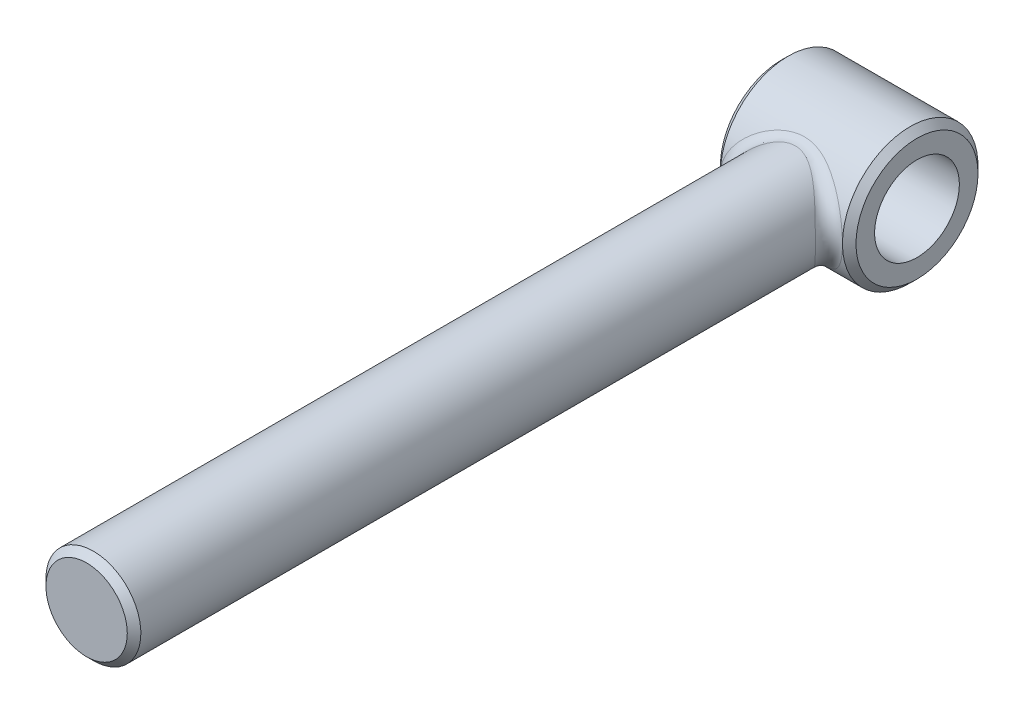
ISO-10303-21;
HEADER;
FILE_DESCRIPTION(('STEP AP214'),'2;1');
FILE_NAME('part.step','',(''),(''),'','','');
FILE_SCHEMA(('AUTOMOTIVE_DESIGN { 1 0 10303 214 1 1 1 1 }'));
ENDSEC;
DATA;
#1=APPLICATION_CONTEXT('core data for automotive mechanical design processes');
#2=APPLICATION_PROTOCOL_DEFINITION('international standard','automotive_design',2000,#1);
#3=PRODUCT_CONTEXT('',#1,'mechanical');
#4=PRODUCT('Part','Part','',(#3));
#5=PRODUCT_RELATED_PRODUCT_CATEGORY('part','',(#4));
#6=PRODUCT_DEFINITION_FORMATION('','',#4);
#7=PRODUCT_DEFINITION_CONTEXT('part definition',#1,'design');
#8=PRODUCT_DEFINITION('design','',#6,#7);
#9=PRODUCT_DEFINITION_SHAPE('','',#8);
#10=(LENGTH_UNIT() NAMED_UNIT(*) SI_UNIT(.MILLI.,.METRE.));
#11=(NAMED_UNIT(*) PLANE_ANGLE_UNIT() SI_UNIT($,.RADIAN.));
#12=(NAMED_UNIT(*) SI_UNIT($,.STERADIAN.) SOLID_ANGLE_UNIT());
#13=UNCERTAINTY_MEASURE_WITH_UNIT(LENGTH_MEASURE(1.E-05),#10,'distance_accuracy_value','');
#14=(GEOMETRIC_REPRESENTATION_CONTEXT(3) GLOBAL_UNCERTAINTY_ASSIGNED_CONTEXT((#13)) GLOBAL_UNIT_ASSIGNED_CONTEXT((#10,
#11,#12)) REPRESENTATION_CONTEXT('',''));
#15=CARTESIAN_POINT('',(0.,0.,0.));
#16=DIRECTION('',(0.,0.,1.));
#17=DIRECTION('',(1.,0.,0.));
#18=AXIS2_PLACEMENT_3D('',#15,#16,#17);
#19=CARTESIAN_POINT('',(40.,0.,0.));
#20=DIRECTION('',(-1.,0.,0.));
#21=DIRECTION('',(0.,0.,1.));
#22=AXIS2_PLACEMENT_3D('',#19,#20,#21);
#23=CYLINDRICAL_SURFACE('',#22,40.);
#24=CARTESIAN_POINT('',(35.8391392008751,2.83285551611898,39.8995605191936));
#25=CARTESIAN_POINT('',(27.9277936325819,2.08620959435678,39.9525721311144));
#26=CARTESIAN_POINT('',(27.8748860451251,2.64399848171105,47.8794726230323));
#27=CARTESIAN_POINT('',(35.9197341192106,2.12477632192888,39.949833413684));
#28=CARTESIAN_POINT('',(27.9643885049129,1.55951387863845,39.9766298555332));
#29=CARTESIAN_POINT('',(27.9375709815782,1.98312456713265,47.9398000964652));
#30=CARTESIAN_POINT('',(35.9702232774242,1.41297434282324,39.9813914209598));
#31=CARTESIAN_POINT('',(27.9867553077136,1.03651322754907,39.9913072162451));
#32=CARTESIAN_POINT('',(27.9768403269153,1.31877605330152,47.9776697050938));
#33=CARTESIAN_POINT('',(36.010160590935,-0.0124937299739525,40.0063492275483));
#34=CARTESIAN_POINT('',(28.0045284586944,-0.00966208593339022,40.0029724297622));
#35=CARTESIAN_POINT('',(28.0079026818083,-0.0116608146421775,48.0076190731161));
#36=CARTESIAN_POINT('',(35.999608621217,-0.726159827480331,39.9997489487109));
#37=CARTESIAN_POINT('',(27.9998897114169,-0.531505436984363,39.9999306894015));
#38=CARTESIAN_POINT('',(27.99969559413,-0.677749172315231,47.9996987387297));
#39=CARTESIAN_POINT('',(35.9176356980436,-2.14974215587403,39.9485417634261));
#40=CARTESIAN_POINT('',(27.9632662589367,-1.57890613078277,39.9758846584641));
#41=CARTESIAN_POINT('',(27.9359388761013,-2.00642601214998,47.938250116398));
#42=CARTESIAN_POINT('',(35.8462090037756,-2.85965802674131,39.9039312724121));
#43=CARTESIAN_POINT('',(27.9313715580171,-2.10313863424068,39.9549394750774));
#44=CARTESIAN_POINT('',(27.8803847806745,-2.66901415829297,47.8847175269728));
#45=CARTESIAN_POINT('',(35.6436368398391,-4.27018639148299,39.7777185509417));
#46=CARTESIAN_POINT('',(27.838519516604,-3.15809509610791,39.8938429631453));
#47=CARTESIAN_POINT('',(27.7228286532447,-3.98550729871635,47.7332622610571));
#48=CARTESIAN_POINT('',(35.5124924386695,-4.97079905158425,39.6961169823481));
#49=CARTESIAN_POINT('',(27.7777929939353,-3.68753819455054,39.853843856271));
#50=CARTESIAN_POINT('',(27.6208274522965,-4.63941244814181,47.6353403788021));
#51=CARTESIAN_POINT('',(35.2001230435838,-6.32471435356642,39.5024465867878));
#52=CARTESIAN_POINT('',(27.6282469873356,-4.72907822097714,39.7551574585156));
#53=CARTESIAN_POINT('',(27.3778734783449,-5.90306672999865,47.4029359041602));
#54=CARTESIAN_POINT('',(35.0215739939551,-6.97868308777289,39.392009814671));
#55=CARTESIAN_POINT('',(27.5412435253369,-5.2395986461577,39.6976763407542));
#56=CARTESIAN_POINT('',(27.2390019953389,-6.51343754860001,47.2704117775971));
#57=CARTESIAN_POINT('',(34.6144532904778,-8.26980736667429,39.1413177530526));
#58=CARTESIAN_POINT('',(27.3358879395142,-6.26738445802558,39.5618747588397));
#59=CARTESIAN_POINT('',(26.922352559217,-7.71848687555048,46.969581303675));
#60=CARTESIAN_POINT('',(34.3858836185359,-8.90696357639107,39.0010636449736));
#61=CARTESIAN_POINT('',(27.2179530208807,-6.78373282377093,39.4838310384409));
#62=CARTESIAN_POINT('',(26.7445761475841,-8.31316600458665,46.8012763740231));
#63=CARTESIAN_POINT('',(33.8813622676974,-10.1613190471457,38.6932128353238));
#64=CARTESIAN_POINT('',(26.9482869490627,-7.821465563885,39.3054538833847));
#65=CARTESIAN_POINT('',(26.3521706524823,-9.48389777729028,46.4318554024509));
#66=CARTESIAN_POINT('',(33.6054077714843,-10.7785171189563,38.5256145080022));
#67=CARTESIAN_POINT('',(26.7970515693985,-8.34208195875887,39.2054477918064));
#68=CARTESIAN_POINT('',(26.1375393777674,-10.0599493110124,46.2307374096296));
#69=CARTESIAN_POINT('',(33.0089268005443,-11.990407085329,38.1658197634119));
#70=CARTESIAN_POINT('',(26.4588221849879,-9.38545733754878,38.98227425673));
#71=CARTESIAN_POINT('',(25.6736097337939,-11.1910466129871,45.7989837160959));
#72=CARTESIAN_POINT('',(32.6883943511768,-12.5850959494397,37.9736200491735));
#73=CARTESIAN_POINT('',(26.2723757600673,-9.90762347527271,38.8594637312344));
#74=CARTESIAN_POINT('',(25.4243067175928,-11.7460895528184,45.5683440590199));
#75=CARTESIAN_POINT('',(31.9722187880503,-13.8068600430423,37.5476901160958));
#76=CARTESIAN_POINT('',(25.8426140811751,-11.0007942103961,38.5775500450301));
#77=CARTESIAN_POINT('',(24.8672812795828,-12.8864027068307,45.0572281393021));
#78=CARTESIAN_POINT('',(31.5722960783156,-14.4314171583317,37.3117366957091));
#79=CARTESIAN_POINT('',(25.5959917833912,-11.571723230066,38.4163671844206));
#80=CARTESIAN_POINT('',(24.5562302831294,-13.4693226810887,44.774084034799));
#81=CARTESIAN_POINT('',(30.7257558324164,-15.6489465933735,36.8176887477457));
#82=CARTESIAN_POINT('',(25.057270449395,-12.7063786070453,38.0667982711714));
#83=CARTESIAN_POINT('',(23.8978100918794,-14.6056834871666,44.1812264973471));
#84=CARTESIAN_POINT('',(30.2791357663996,-16.2419171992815,36.5595930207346));
#85=CARTESIAN_POINT('',(24.7659161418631,-13.2698362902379,37.8788663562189));
#86=CARTESIAN_POINT('',(23.55043892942,-15.1591227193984,43.8715116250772));
#87=CARTESIAN_POINT('',(29.3421937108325,-17.3952096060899,36.0251416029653));
#88=CARTESIAN_POINT('',(24.1376889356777,-14.3844471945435,37.4776756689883));
#89=CARTESIAN_POINT('',(22.8217062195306,-16.2355289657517,43.2301699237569));
#90=CARTESIAN_POINT('',(28.8518478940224,-17.9555133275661,35.7487759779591));
#91=CARTESIAN_POINT('',(23.801480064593,-14.9355740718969,37.2647946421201));
#92=CARTESIAN_POINT('',(22.4403261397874,-16.7584791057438,42.898531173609));
#93=CARTESIAN_POINT('',(27.830446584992,-19.0422108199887,35.1819536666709));
#94=CARTESIAN_POINT('',(23.0844236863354,-16.0201691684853,36.8166874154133));
#95=CARTESIAN_POINT('',(21.6459028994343,-17.7727300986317,42.2183443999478));
#96=CARTESIAN_POINT('',(27.2993868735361,-19.568601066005,34.8914955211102));
#97=CARTESIAN_POINT('',(22.7041722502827,-16.5538231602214,36.5817628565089));
#98=CARTESIAN_POINT('',(21.2328564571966,-18.2640276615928,41.8697946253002));
#99=CARTESIAN_POINT('',(26.0921825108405,-20.6855029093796,34.2433009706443));
#100=CARTESIAN_POINT('',(21.8232926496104,-17.6988075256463,36.0464922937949));
#101=CARTESIAN_POINT('',(20.2939197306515,-19.3064693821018,41.0919611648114));
#102=CARTESIAN_POINT('',(25.4078694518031,-21.2686632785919,33.8834376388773));
#103=CARTESIAN_POINT('',(21.3130851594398,-18.3073813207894,35.741816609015));
#104=CARTESIAN_POINT('',(19.7616762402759,-19.8507523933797,40.6601251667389));
#105=CARTESIAN_POINT('',(23.9874839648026,-22.3847941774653,33.1566671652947));
#106=CARTESIAN_POINT('',(20.2327768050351,-19.4858572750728,35.1131872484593));
#107=CARTESIAN_POINT('',(18.6569319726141,-20.8924745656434,39.7880005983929));
#108=CARTESIAN_POINT('',(23.2514024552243,-22.9177558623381,32.7897587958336));
#109=CARTESIAN_POINT('',(19.6632463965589,-20.0566093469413,34.7893450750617));
#110=CARTESIAN_POINT('',(18.0844241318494,-21.3899054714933,39.3477105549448));
#111=CARTESIAN_POINT('',(21.7289744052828,-23.9328170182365,32.0563962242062));
#112=CARTESIAN_POINT('',(18.4661934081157,-21.1536688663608,34.1309430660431));
#113=CARTESIAN_POINT('',(16.9003134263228,-22.3372958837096,38.467675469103));
#114=CARTESIAN_POINT('',(20.9425910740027,-24.4148785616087,31.6899425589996));
#115=CARTESIAN_POINT('',(17.8389402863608,-21.680968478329,33.7962625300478));
#116=CARTESIAN_POINT('',(16.2886819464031,-22.7872199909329,38.0279310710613));
#117=CARTESIAN_POINT('',(19.3212383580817,-25.3262850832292,30.9663950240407));
#118=CARTESIAN_POINT('',(16.5288742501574,-22.6849590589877,33.1265354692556));
#119=CARTESIAN_POINT('',(15.0276298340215,-23.6378660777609,37.1596740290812));
#120=CARTESIAN_POINT('',(18.4862774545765,-25.7556392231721,30.6092995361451));
#121=CARTESIAN_POINT('',(15.8461172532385,-23.1627705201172,32.7911675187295));
#122=CARTESIAN_POINT('',(14.3782157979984,-24.0385966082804,36.731159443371));
#123=CARTESIAN_POINT('',(16.9030602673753,-26.4965451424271,29.9688824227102));
#124=CARTESIAN_POINT('',(14.5371168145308,-23.9923286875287,32.1829930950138));
#125=CARTESIAN_POINT('',(13.1468246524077,-24.73010879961,35.9626589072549));
#126=CARTESIAN_POINT('',(16.1617534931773,-26.8160105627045,29.6827762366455));
#127=CARTESIAN_POINT('',(13.9196197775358,-24.352237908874,31.9087370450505));
#128=CARTESIAN_POINT('',(12.5702527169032,-25.0282765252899,35.6193314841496));
#129=CARTESIAN_POINT('',(14.6451096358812,-27.4143185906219,29.1310945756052));
#130=CARTESIAN_POINT('',(12.6475221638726,-25.028639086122,31.3762711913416));
#131=CARTESIAN_POINT('',(11.3906408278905,-25.5866973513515,34.9573134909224));
#132=CARTESIAN_POINT('',(13.8697719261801,-27.693160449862,28.8655194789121));
#133=CARTESIAN_POINT('',(11.9926189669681,-25.3458158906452,31.1176727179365));
#134=CARTESIAN_POINT('',(10.7876003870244,-25.8469497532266,34.6386233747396));
#135=CARTESIAN_POINT('',(12.2872397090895,-28.207363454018,28.363244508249));
#136=CARTESIAN_POINT('',(10.6486019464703,-25.9321497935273,30.6260688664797));
#137=CARTESIAN_POINT('',(9.556741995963,-26.3268725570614,34.0358934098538));
#138=CARTESIAN_POINT('',(11.4801050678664,-28.4428019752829,28.1264935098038));
#139=CARTESIAN_POINT('',(9.95908799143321,-26.2020465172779,30.3925750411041));
#140=CARTESIAN_POINT('',(8.92897060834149,-26.5466151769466,33.7517922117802));
#141=CARTESIAN_POINT('',(9.83453959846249,-28.8677914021,27.6901338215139));
#142=CARTESIAN_POINT('',(8.54756238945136,-26.6899620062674,29.9606950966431));
#143=CARTESIAN_POINT('',(7.64908635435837,-26.9432719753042,33.2281605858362));
#144=CARTESIAN_POINT('',(8.99611820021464,-29.0573560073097,27.490514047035));
#145=CARTESIAN_POINT('',(7.82490162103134,-26.908601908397,29.7618271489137));
#146=CARTESIAN_POINT('',(6.99698082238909,-27.1201989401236,32.9886168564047));
#147=CARTESIAN_POINT('',(7.47882146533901,-29.3510075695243,27.1763484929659));
#148=CARTESIAN_POINT('',(6.5127622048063,-27.2476728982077,29.4480452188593));
#149=CARTESIAN_POINT('',(5.81686113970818,-27.3942737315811,32.6116181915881));
#150=CARTESIAN_POINT('',(6.80532207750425,-29.4647236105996,27.0527467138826));
#151=CARTESIAN_POINT('',(5.92892799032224,-27.3792758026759,29.3241647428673));
#152=CARTESIAN_POINT('',(5.29302828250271,-27.5004087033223,32.4632960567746));
#153=CARTESIAN_POINT('',(5.44437071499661,-29.6605261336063,26.837928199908));
#154=CARTESIAN_POINT('',(4.74735804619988,-27.6059258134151,29.108648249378));
#155=CARTESIAN_POINT('',(4.23451055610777,-27.6831577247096,32.2055138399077));
#156=CARTESIAN_POINT('',(4.75692060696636,-29.7426168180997,26.7467071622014));
#157=CARTESIAN_POINT('',(4.14914156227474,-27.7011795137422,29.0168231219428));
#158=CARTESIAN_POINT('',(3.69982713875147,-27.759775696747,32.096048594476));
#159=CARTESIAN_POINT('',(3.37282982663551,-29.8736745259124,26.6002496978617));
#160=CARTESIAN_POINT('',(2.94371521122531,-27.8532076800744,28.8693718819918));
#161=CARTESIAN_POINT('',(2.62331208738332,-27.8820962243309,31.9202996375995));
#162=CARTESIAN_POINT('',(2.67620157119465,-29.9226823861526,26.5449689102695));
#163=CARTESIAN_POINT('',(2.33597477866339,-27.910171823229,28.8135652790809));
#164=CARTESIAN_POINT('',(2.08149011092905,-27.9278368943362,31.853962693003));
#165=CARTESIAN_POINT('',(1.27781233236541,-29.9867734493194,26.4725480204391));
#166=CARTESIAN_POINT('',(1.11585075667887,-27.9846105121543,28.7405020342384));
#167=CARTESIAN_POINT('',(0.993854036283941,-27.9876552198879,31.7670576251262));
#168=CARTESIAN_POINT('',(0.576051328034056,-30.0018565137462,26.455408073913));
#169=CARTESIAN_POINT('',(0.502881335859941,-28.0021570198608,28.7231749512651));
#170=CARTESIAN_POINT('',(0.448039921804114,-28.0017327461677,31.7464896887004));
#171=CARTESIAN_POINT('',(-0.828244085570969,-29.9977754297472,26.4600354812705));
#172=CARTESIAN_POINT('',(-0.723085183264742,-27.9974151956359,28.7278463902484));
#173=CARTESIAN_POINT('',(-0.644189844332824,-27.9979237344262,31.7520425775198));
#174=CARTESIAN_POINT('',(-1.53077797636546,-29.9785574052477,26.4818640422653));
#175=CARTESIAN_POINT('',(-1.33668280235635,-27.975059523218,28.7499113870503));
#176=CARTESIAN_POINT('',(-1.19060509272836,-27.9799869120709,31.7782368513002));
#177=CARTESIAN_POINT('',(-2.93006258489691,-29.9061750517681,26.5635770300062));
#178=CARTESIAN_POINT('',(-2.5573993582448,-27.8909997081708,28.8323348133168));
#179=CARTESIAN_POINT('',(-2.27893756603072,-27.9124300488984,31.8762924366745));
#180=CARTESIAN_POINT('',(-3.62681331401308,-29.8530107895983,26.6234613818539));
#181=CARTESIAN_POINT('',(-3.16510314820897,-27.8292141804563,28.8927727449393));
#182=CARTESIAN_POINT('',(-2.82085479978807,-27.8628100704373,31.9481536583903));
#183=CARTESIAN_POINT('',(-5.01058060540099,-29.7136851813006,26.7788675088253));
#184=CARTESIAN_POINT('',(-4.36986973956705,-27.6676294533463,29.0491782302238));
#185=CARTESIAN_POINT('',(-3.8971182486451,-27.7327728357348,32.1346410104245));
#186=CARTESIAN_POINT('',(-5.69758398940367,-29.6274828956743,26.8744334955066));
#187=CARTESIAN_POINT('',(-4.96745802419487,-27.5676319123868,29.1453336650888));
#188=CARTESIAN_POINT('',(-4.43145421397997,-27.6523173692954,32.2493201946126));
#189=CARTESIAN_POINT('',(-7.0571869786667,-29.4235532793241,27.0975511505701));
#190=CARTESIAN_POINT('',(-6.14729358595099,-27.3316511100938,29.3690561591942));
#191=CARTESIAN_POINT('',(-5.48892320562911,-27.4619830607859,32.5170613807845));
#192=CARTESIAN_POINT('',(-7.72978447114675,-29.3058213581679,27.2251074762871));
#193=CARTESIAN_POINT('',(-6.73001488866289,-27.1954534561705,29.4968181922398));
#194=CARTESIAN_POINT('',(-6.0120545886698,-27.3520999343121,32.6701289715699));
#195=CARTESIAN_POINT('',(-9.27895499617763,-28.9962796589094,27.555082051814));
#196=CARTESIAN_POINT('',(-8.06899721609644,-26.8381515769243,29.8261864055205));
#197=CARTESIAN_POINT('',(-7.21696499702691,-27.0631943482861,33.066098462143));
#198=CARTESIAN_POINT('',(-10.1488955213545,-28.7928566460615,27.7682858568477));
#199=CARTESIAN_POINT('',(-8.81816788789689,-26.6036428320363,30.03839571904));
#200=CARTESIAN_POINT('',(-7.89358540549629,-26.8733328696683,33.3219430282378));
#201=CARTESIAN_POINT('',(-11.8544521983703,-28.3367030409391,28.2336195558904));
#202=CARTESIAN_POINT('',(-10.2793291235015,-26.0803956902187,30.4983071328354));
#203=CARTESIAN_POINT('',(-9.22012948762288,-26.4475895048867,33.8803434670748));
#204=CARTESIAN_POINT('',(-12.6900561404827,-28.0839550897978,28.4857631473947));
#205=CARTESIAN_POINT('',(-10.9920207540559,-25.7909425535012,30.7465538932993));
#206=CARTESIAN_POINT('',(-9.87004366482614,-26.2116914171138,34.1829157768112));
#207=CARTESIAN_POINT('',(-14.326954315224,-27.5317972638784,29.019785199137));
#208=CARTESIAN_POINT('',(-12.3793374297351,-25.1622227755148,31.2680186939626));
#209=CARTESIAN_POINT('',(-11.1431866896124,-25.6963441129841,34.823742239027));
#210=CARTESIAN_POINT('',(-15.1281643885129,-27.2322804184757,29.30173133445));
#211=CARTESIAN_POINT('',(-13.0543580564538,-24.8220923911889,31.5417863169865));
#212=CARTESIAN_POINT('',(-11.7663500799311,-25.4167950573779,35.1620776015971));
#213=CARTESIAN_POINT('',(-16.6935103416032,-26.5895773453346,29.8861696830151));
#214=CARTESIAN_POINT('',(-14.3631643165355,-24.0970856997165,32.1038750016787));
#215=CARTESIAN_POINT('',(-12.9838413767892,-24.8169388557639,35.863403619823));
#216=CARTESIAN_POINT('',(-17.4576460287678,-26.2463908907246,30.1886620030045));
#217=CARTESIAN_POINT('',(-14.9972503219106,-23.7114294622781,32.3926179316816));
#218=CARTESIAN_POINT('',(-13.5781691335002,-24.4966314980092,36.2263944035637));
#219=CARTESIAN_POINT('',(-19.1585270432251,-25.4156727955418,30.8936520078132));
#220=CARTESIAN_POINT('',(-16.3978766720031,-22.7837525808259,33.0590498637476));
#221=CARTESIAN_POINT('',(-14.901076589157,-23.7212946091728,37.0723824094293));
#222=CARTESIAN_POINT('',(-20.0833481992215,-24.9146956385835,31.3003414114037));
#223=CARTESIAN_POINT('',(-17.1491702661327,-22.2284814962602,33.4383028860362));
#224=CARTESIAN_POINT('',(-15.6203819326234,-23.2537159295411,37.560409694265));
#225=CARTESIAN_POINT('',(-21.8710683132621,-23.8465347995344,32.1215980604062));
#226=CARTESIAN_POINT('',(-18.5808186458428,-21.0591277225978,34.1909047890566));
#227=CARTESIAN_POINT('',(-17.0108309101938,-22.2567658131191,38.5459176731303));
#228=CARTESIAN_POINT('',(-22.7339496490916,-23.2793323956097,32.5361675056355));
#229=CARTESIAN_POINT('',(-19.2609463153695,-20.4434765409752,34.5646058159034));
#230=CARTESIAN_POINT('',(-17.6819608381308,-21.7273769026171,39.0434010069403));
#231=CARTESIAN_POINT('',(-24.3948755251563,-22.0809065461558,33.3610913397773));
#232=CARTESIAN_POINT('',(-20.5473624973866,-19.1618550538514,35.2928105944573));
#233=CARTESIAN_POINT('',(-18.9737920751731,-20.6088461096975,40.0333096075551));
#234=CARTESIAN_POINT('',(-25.1929709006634,-21.4497341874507,33.7714488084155));
#235=CARTESIAN_POINT('',(-21.1530803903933,-18.4945584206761,35.6473370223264));
#236=CARTESIAN_POINT('',(-19.5945329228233,-20.0197519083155,40.5257385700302));
#237=CARTESIAN_POINT('',(-26.7213202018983,-20.1243828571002,34.5776023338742));
#238=CARTESIAN_POINT('',(-22.2885963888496,-17.1180253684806,36.326552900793));
#239=CARTESIAN_POINT('',(-20.7832490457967,-18.7827573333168,41.4931228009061));
#240=CARTESIAN_POINT('',(-27.4515919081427,-19.4302204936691,34.9734021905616));
#241=CARTESIAN_POINT('',(-22.8173640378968,-16.4077739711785,36.6508891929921));
#242=CARTESIAN_POINT('',(-21.3512381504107,-18.1348724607,41.9680826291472));
#243=CARTESIAN_POINT('',(-28.7200040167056,-18.1048401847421,35.6745910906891));
#244=CARTESIAN_POINT('',(-23.7113578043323,-15.0818818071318,37.2078056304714));
#245=CARTESIAN_POINT('',(-22.337780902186,-16.8978508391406,42.809509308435));
#246=CARTESIAN_POINT('',(-29.2696086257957,-17.4832662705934,35.9838384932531));
#247=CARTESIAN_POINT('',(-24.0892914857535,-14.4689577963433,37.4468265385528));
#248=CARTESIAN_POINT('',(-22.7652511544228,-16.3177151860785,43.1806061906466));
#249=CARTESIAN_POINT('',(-30.3148312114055,-16.1992230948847,36.5798570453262));
#250=CARTESIAN_POINT('',(-24.7905738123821,-13.2274169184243,37.8945562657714));
#251=CARTESIAN_POINT('',(-23.5782020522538,-15.1192748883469,43.8958284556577));
#252=CARTESIAN_POINT('',(-30.8104597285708,-15.5367618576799,36.8666325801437));
#253=CARTESIAN_POINT('',(-25.1129808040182,-12.5988284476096,38.1027300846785));
#254=CARTESIAN_POINT('',(-23.9636908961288,-14.5009777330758,44.2399591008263));
#255=CARTESIAN_POINT('',(-31.7431587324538,-14.1730010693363,37.4120991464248));
#256=CARTESIAN_POINT('',(-25.7032068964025,-11.3328395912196,38.4862290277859));
#257=CARTESIAN_POINT('',(-24.6891234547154,-13.2281343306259,44.8945189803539));
#258=CARTESIAN_POINT('',(-32.1802478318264,-13.471713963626,37.6707990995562));
#259=CARTESIAN_POINT('',(-25.9700057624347,-10.6958479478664,38.6609282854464));
#260=CARTESIAN_POINT('',(-25.0290816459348,-12.5735996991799,45.2049589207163));
#261=CARTESIAN_POINT('',(-32.9910431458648,-12.0329538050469,38.1547369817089));
#262=CARTESIAN_POINT('',(-26.4504243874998,-9.41944643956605,38.9766116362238));
#263=CARTESIAN_POINT('',(-25.6597002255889,-11.2307568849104,45.78568437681));
#264=CARTESIAN_POINT('',(-33.364749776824,-11.2954809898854,38.3799751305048));
#265=CARTESIAN_POINT('',(-26.662995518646,-8.78086286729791,39.1169234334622));
#266=CARTESIAN_POINT('',(-25.9503609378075,-10.542448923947,46.0559701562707));
#267=CARTESIAN_POINT('',(-34.0468800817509,-9.78097121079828,38.7937459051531));
#268=CARTESIAN_POINT('',(-27.0394917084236,-7.50054764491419,39.3657285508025));
#269=CARTESIAN_POINT('',(-26.4809067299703,-9.12890646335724,46.5524950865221));
#270=CARTESIAN_POINT('',(-34.3546279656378,-9.00361730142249,38.9818971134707));
#271=CARTESIAN_POINT('',(-27.2019007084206,-6.86019383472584,39.4732273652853));
#272=CARTESIAN_POINT('',(-26.7202661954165,-8.40337614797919,46.7782765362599));
#273=CARTESIAN_POINT('',(-34.8949720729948,-7.42156861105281,39.3137813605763));
#274=CARTESIAN_POINT('',(-27.4792297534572,-5.5863079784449,39.656686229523));
#275=CARTESIAN_POINT('',(-27.140533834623,-6.92679737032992,47.1765376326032));
#276=CARTESIAN_POINT('',(-35.127562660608,-6.61687178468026,39.4575110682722));
#277=CARTESIAN_POINT('',(-27.5933102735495,-4.95442884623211,39.7320896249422));
#278=CARTESIAN_POINT('',(-27.321437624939,-6.17574699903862,47.3490132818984));
#279=CARTESIAN_POINT('',(-35.5127287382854,-4.98859967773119,39.6962193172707));
#280=CARTESIAN_POINT('',(-27.7783026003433,-3.69926514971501,39.8541914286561));
#281=CARTESIAN_POINT('',(-27.621011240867,-4.65602636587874,47.635463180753));
#282=CARTESIAN_POINT('',(-35.6654397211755,-4.16505885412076,39.7912804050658));
#283=CARTESIAN_POINT('',(-27.8486833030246,-3.07788230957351,39.9005380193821));
#284=CARTESIAN_POINT('',(-27.7397864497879,-3.88738826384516,47.7495364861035));
#285=CARTESIAN_POINT('',(-35.8881270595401,-2.50614178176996,39.9300786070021));
#286=CARTESIAN_POINT('',(-27.9503986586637,-1.84010474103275,39.9674487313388));
#287=CARTESIAN_POINT('',(-27.9129877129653,-2.33906566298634,47.9160943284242));
#288=CARTESIAN_POINT('',(-35.9581399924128,-1.67077093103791,39.9738384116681));
#289=CARTESIAN_POINT('',(-27.981402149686,-1.22579396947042,39.9877946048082));
#290=CARTESIAN_POINT('',(-27.9674422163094,-1.5593862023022,47.9686060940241));
#291=CARTESIAN_POINT('',(-36.0026320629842,-0.338580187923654,40.0016456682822));
#292=CARTESIAN_POINT('',(-28.0011641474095,-0.247981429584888,40.0007637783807));
#293=CARTESIAN_POINT('',(-28.0020471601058,-0.316008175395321,48.0019748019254));
#294=CARTESIAN_POINT('',(-36.0044220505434,0.157419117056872,40.0027636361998));
#295=CARTESIAN_POINT('',(-28.0019670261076,0.115205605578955,40.0012909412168));
#296=CARTESIAN_POINT('',(-28.0034393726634,0.146924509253,48.0033163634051));
#297=CARTESIAN_POINT('',(-35.9785174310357,1.14866269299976,39.9865740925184));
#298=CARTESIAN_POINT('',(-27.9904495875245,0.842608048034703,39.9937322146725));
#299=CARTESIAN_POINT('',(-27.9832913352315,1.07208518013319,47.9838889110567));
#300=CARTESIAN_POINT('',(-35.9508206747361,1.64390690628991,39.9692652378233));
#301=CARTESIAN_POINT('',(-27.9781424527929,1.20637682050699,39.9856549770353));
#302=CARTESIAN_POINT('',(-27.9617494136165,1.53431311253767,47.9631182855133));
#303=CARTESIAN_POINT('',(-35.8661523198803,2.63153897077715,39.9164065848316));
#304=CARTESIAN_POINT('',(-27.9400825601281,1.93588019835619,39.9606523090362));
#305=CARTESIAN_POINT('',(-27.8958962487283,2.45610303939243,47.8996879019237));
#306=CARTESIAN_POINT('',(-35.8091883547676,3.12392753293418,39.880861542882));
#307=CARTESIAN_POINT('',(-27.9143796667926,2.30117278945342,39.9437596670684));
#308=CARTESIAN_POINT('',(-27.8515909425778,2.91566569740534,47.8570338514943));
#309=CARTESIAN_POINT('',(-35.666444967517,4.10419276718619,39.7919335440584));
#310=CARTESIAN_POINT('',(-27.8488977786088,3.03469722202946,39.9006709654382));
#311=CARTESIAN_POINT('',(-27.7405683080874,3.83057991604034,47.7503202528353));
#312=CARTESIAN_POINT('',(-35.5806618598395,4.59206885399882,39.7385483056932));
#313=CARTESIAN_POINT('',(-27.809195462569,3.40250088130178,39.8745254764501));
#314=CARTESIAN_POINT('',(-27.6738481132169,4.28593093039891,47.6862579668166));
#315=CARTESIAN_POINT('',(-35.3196191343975,5.85889181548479,39.5764356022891));
#316=CARTESIAN_POINT('',(-27.6861135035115,4.36714211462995,39.793367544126));
#317=CARTESIAN_POINT('',(-27.4708148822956,5.46829902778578,47.4917227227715));
#318=CARTESIAN_POINT('',(-35.1217448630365,6.632940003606,39.4538437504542));
#319=CARTESIAN_POINT('',(-27.5910162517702,4.96669004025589,39.7305760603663));
#320=CARTESIAN_POINT('',(-27.3169126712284,6.19074400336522,47.344612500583));
#321=CARTESIAN_POINT('',(-34.6561058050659,8.15846977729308,39.1668545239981));
#322=CARTESIAN_POINT('',(-27.3576615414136,6.17581812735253,39.5762841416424));
#323=CARTESIAN_POINT('',(-26.9547489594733,7.61457179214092,47.0002254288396));
#324=CARTESIAN_POINT('',(-34.3883139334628,8.90994249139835,39.002440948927));
#325=CARTESIAN_POINT('',(-27.2200486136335,6.78387960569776,39.4852113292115));
#326=CARTESIAN_POINT('',(-26.7464663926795,8.31594632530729,46.8029291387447));
#327=CARTESIAN_POINT('',(-33.7867500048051,10.3860102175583,38.635605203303));
#328=CARTESIAN_POINT('',(-26.8973614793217,8.00796032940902,39.2717750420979));
#329=CARTESIAN_POINT('',(-26.2785833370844,9.6936095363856,46.3627262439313));
#330=CARTESIAN_POINT('',(-33.4528783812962,11.1105626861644,38.4331256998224));
#331=CARTESIAN_POINT('',(-26.7130368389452,8.62275402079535,39.1499063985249));
#332=CARTESIAN_POINT('',(-26.0189054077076,10.3698585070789,46.1197508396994));
#333=CARTESIAN_POINT('',(-32.7240332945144,12.5275709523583,37.9948707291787));
#334=CARTESIAN_POINT('',(-26.2939158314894,9.85440160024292,38.8736556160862));
#335=CARTESIAN_POINT('',(-25.452025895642,11.692399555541,45.5938448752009));
#336=CARTESIAN_POINT('',(-32.3290498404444,13.2200214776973,37.7590898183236));
#337=CARTESIAN_POINT('',(-26.0600327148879,10.4703535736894,38.7198662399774));
#338=CARTESIAN_POINT('',(-25.1448165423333,12.3386867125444,45.3109077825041));
#339=CARTESIAN_POINT('',(-31.4862344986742,14.5639859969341,37.2612338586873));
#340=CARTESIAN_POINT('',(-25.5422409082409,11.6927137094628,38.3814240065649));
#341=CARTESIAN_POINT('',(-24.4892934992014,13.5930535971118,44.7134806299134));
#342=CARTESIAN_POINT('',(-31.0388787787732,15.2157971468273,36.9993985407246));
#343=CARTESIAN_POINT('',(-25.2597282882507,12.298562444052,38.1976443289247));
#344=CARTESIAN_POINT('',(-24.1413501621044,14.2014106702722,44.3992782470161));
#345=CARTESIAN_POINT('',(-30.0928655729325,16.4827595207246,36.4526368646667));
#346=CARTESIAN_POINT('',(-24.6429571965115,13.4993168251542,37.8000208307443));
#347=CARTESIAN_POINT('',(-23.4055621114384,15.3839088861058,43.7431642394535));
#348=CARTESIAN_POINT('',(-29.594207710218,17.0979104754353,36.1677103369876));
#349=CARTESIAN_POINT('',(-24.309577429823,14.0940350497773,37.5866985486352));
#350=CARTESIAN_POINT('',(-23.0177171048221,15.9580497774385,43.4012524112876));
#351=CARTESIAN_POINT('',(-28.54922781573,18.2902241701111,35.5796235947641));
#352=CARTESIAN_POINT('',(-23.5916088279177,15.2661937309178,37.1329288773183));
#353=CARTESIAN_POINT('',(-22.2049549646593,17.0708758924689,42.6955483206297));
#354=CARTESIAN_POINT('',(-28.0029013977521,18.8673834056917,35.2764617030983));
#355=CARTESIAN_POINT('',(-23.2077983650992,15.8437415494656,36.8929018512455));
#356=CARTESIAN_POINT('',(-21.7800344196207,17.6095578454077,42.3317540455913));
#357=CARTESIAN_POINT('',(-26.865669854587,19.982755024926,34.6568404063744));
#358=CARTESIAN_POINT('',(-22.3902135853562,16.975701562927,36.3897768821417));
#359=CARTESIAN_POINT('',(-20.8955209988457,18.6505713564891,41.5882084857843));
#360=CARTESIAN_POINT('',(-26.2747606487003,20.52096383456,34.3403797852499));
#361=CARTESIAN_POINT('',(-21.9570853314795,17.5304618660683,36.126973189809));
#362=CARTESIAN_POINT('',(-20.4359249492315,19.1528995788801,41.2084557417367));
#363=CARTESIAN_POINT('',(-24.9608108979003,21.6339480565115,33.6520565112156));
#364=CARTESIAN_POINT('',(-20.9761142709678,18.6900341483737,35.5437925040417));
#365=CARTESIAN_POINT('',(-19.4139640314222,20.1916848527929,40.3824678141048));
#366=CARTESIAN_POINT('',(-24.2311157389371,22.2024693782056,33.278887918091));
#367=CARTESIAN_POINT('',(-20.4203724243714,19.2922631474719,35.2201998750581));
#368=CARTESIAN_POINT('',(-18.8464233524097,20.7223047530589,39.9346655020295));
#369=CARTESIAN_POINT('',(-22.7188083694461,23.2864229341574,32.5296273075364));
#370=CARTESIAN_POINT('',(-19.2475099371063,20.4525415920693,34.5578050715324));
#371=CARTESIAN_POINT('',(-17.6701842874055,21.7339947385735,39.0355527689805));
#372=CARTESIAN_POINT('',(-21.9361868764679,23.8018458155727,32.1535347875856));
#373=CARTESIAN_POINT('',(-18.6308424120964,21.0116097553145,34.2189867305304));
#374=CARTESIAN_POINT('',(-17.0614786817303,22.2150560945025,38.5842417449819));
#375=CARTESIAN_POINT('',(-20.3194219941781,24.778439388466,31.4071125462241));
#376=CARTESIAN_POINT('',(-17.3383069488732,22.0794489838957,33.5362683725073));
#377=CARTESIAN_POINT('',(-15.8039948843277,23.1265434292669,37.6885350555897));
#378=CARTESIAN_POINT('',(-19.4852626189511,25.2395931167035,31.0367846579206));
#379=CARTESIAN_POINT('',(-16.6625877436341,22.5893648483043,33.1921122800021));
#380=CARTESIAN_POINT('',(-15.1552042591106,23.5569535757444,37.2441415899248));
#381=CARTESIAN_POINT('',(-17.7665098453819,26.1055451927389,30.3120276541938));
#382=CARTESIAN_POINT('',(-15.2542090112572,23.5526469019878,32.5106473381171));
#383=CARTESIAN_POINT('',(-13.8183965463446,24.3651755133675,36.37443318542));
#384=CARTESIAN_POINT('',(-16.8819297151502,26.5103582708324,29.9575943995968));
#385=CARTESIAN_POINT('',(-14.521430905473,24.0072474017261,32.1728657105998));
#386=CARTESIAN_POINT('',(-13.1303897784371,24.743001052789,35.9491132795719));
#387=CARTESIAN_POINT('',(-15.2699116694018,27.1754081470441,29.3538856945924));
#388=CARTESIAN_POINT('',(-13.1725465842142,24.7581561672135,31.5918227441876));
#389=CARTESIAN_POINT('',(-11.8765979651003,25.3637142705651,35.2246628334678));
#390=CARTESIAN_POINT('',(-14.5525478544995,27.447577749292,29.0990404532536));
#391=CARTESIAN_POINT('',(-12.5688570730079,25.0669017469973,31.3447344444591));
#392=CARTESIAN_POINT('',(-11.318648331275,25.6177392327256,34.9188485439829));
#393=CARTESIAN_POINT('',(-13.0883276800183,27.9548765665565,28.6120334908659));
#394=CARTESIAN_POINT('',(-11.3298452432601,25.6439120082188,30.8700171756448));
#395=CARTESIAN_POINT('',(-10.1798104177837,26.0912181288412,34.3344401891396));
#396=CARTESIAN_POINT('',(-12.3414723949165,28.1900071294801,28.379870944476));
#397=CARTESIAN_POINT('',(-10.6941805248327,25.9127298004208,30.6420318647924));
#398=CARTESIAN_POINT('',(-9.5989229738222,26.310673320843,34.055845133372));
#399=CARTESIAN_POINT('',(-10.820805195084,28.6205265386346,27.9456407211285));
#400=CARTESIAN_POINT('',(-9.39430928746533,26.4058266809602,30.2139266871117));
#401=CARTESIAN_POINT('',(-8.41618181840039,26.7124914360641,33.5347688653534));
#402=CARTESIAN_POINT('',(-10.0470468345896,28.8159895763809,27.7435170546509));
#403=CARTESIAN_POINT('',(-8.72968228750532,26.630703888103,30.0133731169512));
#404=CARTESIAN_POINT('',(-7.81436976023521,26.8949236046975,33.292220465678));
#405=CARTESIAN_POINT('',(-8.47360052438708,29.1650036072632,27.3763925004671));
#406=CARTESIAN_POINT('',(-7.37385961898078,27.0326418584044,29.6481552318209));
#407=CARTESIAN_POINT('',(-6.59057818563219,27.2206700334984,32.8516710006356));
#408=CARTESIAN_POINT('',(-7.67391854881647,29.3185641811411,27.2113831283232));
#409=CARTESIAN_POINT('',(-6.68203528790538,27.2101764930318,29.4830993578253));
#410=CARTESIAN_POINT('',(-5.96860331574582,27.3639932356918,32.6536597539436));
#411=CARTESIAN_POINT('',(-6.19778273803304,29.5574688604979,26.9514633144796));
#412=CARTESIAN_POINT('',(-5.40191385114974,27.4865417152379,29.2226735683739));
#413=CARTESIAN_POINT('',(-4.82049768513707,27.5869709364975,32.3417559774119));
#414=CARTESIAN_POINT('',(-5.52486596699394,29.6501012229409,26.8492941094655));
#415=CARTESIAN_POINT('',(-4.81709283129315,27.5939293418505,29.119979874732));
#416=CARTESIAN_POINT('',(-4.2971179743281,27.6734278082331,32.2191529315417));
#417=CARTESIAN_POINT('',(-4.16774846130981,29.8037395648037,26.6786501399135));
#418=CARTESIAN_POINT('',(-3.63637318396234,27.7720259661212,28.9483770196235));
#419=CARTESIAN_POINT('',(-3.24158213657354,27.8168235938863,32.0143801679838));
#420=CARTESIAN_POINT('',(-3.48354912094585,29.8647494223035,26.6101712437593));
#421=CARTESIAN_POINT('',(-3.03997462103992,27.8428989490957,28.8793134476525));
#422=CARTESIAN_POINT('',(-2.70942709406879,27.8737661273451,31.9322054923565));
#423=CARTESIAN_POINT('',(-2.10882507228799,29.9539892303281,26.5096791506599));
#424=CARTESIAN_POINT('',(-1.8411797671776,27.9465072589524,28.7779944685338));
#425=CARTESIAN_POINT('',(-1.64019727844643,27.9570566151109,31.8116149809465));
#426=CARTESIAN_POINT('',(-1.41830660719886,29.982248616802,26.4776332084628));
#427=CARTESIAN_POINT('',(-1.23824119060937,27.9793733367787,28.7456122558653));
#428=CARTESIAN_POINT('',(-1.10312736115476,27.9834320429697,31.7731598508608));
#429=CARTESIAN_POINT('',(-0.0353984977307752,30.0055206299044,26.4512581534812));
#430=CARTESIAN_POINT('',(-0.0310348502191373,28.0064115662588,28.7189886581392));
#431=CARTESIAN_POINT('',(-0.0275321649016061,28.0051525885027,31.7415097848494));
#432=CARTESIAN_POINT('',(0.656991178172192,30.0005326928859,26.4569296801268));
#433=CARTESIAN_POINT('',(0.573805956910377,28.0006087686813,28.7247225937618));
#434=CARTESIAN_POINT('',(0.51099313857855,28.0004971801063,31.7483156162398));
#435=CARTESIAN_POINT('',(2.03785875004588,29.9574258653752,26.5057289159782));
#436=CARTESIAN_POINT('',(1.7790062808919,27.9505319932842,28.7739713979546));
#437=CARTESIAN_POINT('',(1.5850012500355,27.9602641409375,31.8068746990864));
#438=CARTESIAN_POINT('',(2.72633905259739,29.9193302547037,26.5488303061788));
#439=CARTESIAN_POINT('',(2.37993653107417,27.906237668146,28.8175062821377));
#440=CARTESIAN_POINT('',(2.12048592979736,27.9247082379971,31.8585963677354));
#441=CARTESIAN_POINT('',(4.094971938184,29.8107903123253,26.6706463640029));
#442=CARTESIAN_POINT('',(3.5727554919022,27.7802695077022,28.940247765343));
#443=CARTESIAN_POINT('',(3.18497817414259,27.8234042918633,32.0047756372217));
#444=CARTESIAN_POINT('',(4.77512450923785,29.7403459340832,26.7493610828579));
#445=CARTESIAN_POINT('',(4.16517935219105,27.6984795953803,29.019566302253));
#446=CARTESIAN_POINT('',(3.71398572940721,27.7576562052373,32.0992332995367));
#447=CARTESIAN_POINT('',(6.12397543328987,29.5682258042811,26.9394954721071));
#448=CARTESIAN_POINT('',(5.33762016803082,27.499082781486,29.2105709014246));
#449=CARTESIAN_POINT('',(4.76309200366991,27.5970107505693,32.3273945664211));
#450=CARTESIAN_POINT('',(6.79265623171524,29.466506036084,27.0509612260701));
#451=CARTESIAN_POINT('',(5.91809968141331,27.3812499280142,29.3224658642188));
#452=CARTESIAN_POINT('',(5.28317706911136,27.5020723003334,32.4611534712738));
#453=CARTESIAN_POINT('',(8.11453623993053,29.2333875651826,27.3027184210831));
#454=CARTESIAN_POINT('',(7.06258715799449,27.1119100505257,29.5742602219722));
#455=CARTESIAN_POINT('',(6.31130596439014,27.2844950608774,32.7632621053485));
#456=CARTESIAN_POINT('',(8.76773325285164,29.1019846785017,27.4430139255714));
#457=CARTESIAN_POINT('',(7.62700950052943,26.9601751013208,29.7143606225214));
#458=CARTESIAN_POINT('',(6.81934808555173,27.1618523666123,32.9316167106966));
#459=CARTESIAN_POINT('',(10.3222757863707,28.7510812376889,27.8112190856));
#460=CARTESIAN_POINT('',(8.96705086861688,26.5558367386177,30.0807779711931));
#461=CARTESIAN_POINT('',(8.02843672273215,26.8343424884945,33.3734629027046));
#462=CARTESIAN_POINT('',(11.2149206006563,28.5175935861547,28.0514055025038));
#463=CARTESIAN_POINT('',(9.73304420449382,26.2872927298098,30.3189063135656));
#464=CARTESIAN_POINT('',(8.72271602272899,26.6164206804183,33.6616866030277));
#465=CARTESIAN_POINT('',(12.9619270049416,27.9986285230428,28.5694090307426));
#466=CARTESIAN_POINT('',(11.2233055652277,25.6937417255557,30.8284139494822));
#467=CARTESIAN_POINT('',(10.0814987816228,26.132053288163,34.2832908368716));
#468=CARTESIAN_POINT('',(13.8162718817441,27.7131286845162,28.8472423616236));
#469=CARTESIAN_POINT('',(11.9482540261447,25.3678912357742,31.1003980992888));
#470=CARTESIAN_POINT('',(10.7459892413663,25.8655867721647,34.6166908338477));
#471=CARTESIAN_POINT('',(15.4865596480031,27.0929946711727,29.4304449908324));
#472=CARTESIAN_POINT('',(13.3553868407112,24.6646847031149,31.6660629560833));
#473=CARTESIAN_POINT('',(12.045101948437,25.2867950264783,35.3165339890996));
#474=CARTESIAN_POINT('',(16.3024368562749,26.7582802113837,29.735858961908));
#475=CARTESIAN_POINT('',(14.0379455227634,24.286378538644,31.9603013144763));
#476=CARTESIAN_POINT('',(12.6796731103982,24.9743948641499,35.6830307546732));
#477=CARTESIAN_POINT('',(17.8937307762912,26.0425912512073,30.3646233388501));
#478=CARTESIAN_POINT('',(15.3576994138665,23.4835562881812,32.5595480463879));
#479=CARTESIAN_POINT('',(13.9173461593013,24.306418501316,36.4375480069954));
#480=CARTESIAN_POINT('',(18.66915187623,25.6616217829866,30.6879717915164));
#481=CARTESIAN_POINT('',(15.9951336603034,23.0581602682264,32.864977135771));
#482=CARTESIAN_POINT('',(14.5204514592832,23.9508469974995,36.8255661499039));
#483=CARTESIAN_POINT('',(20.206522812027,24.8405987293,31.3565773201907));
#484=CARTESIAN_POINT('',(17.246145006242,22.1492139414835,33.4887475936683));
#485=CARTESIAN_POINT('',(15.7161844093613,23.1845588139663,37.6278927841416));
#486=CARTESIAN_POINT('',(20.9669837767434,24.3989123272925,31.7022040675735));
#487=CARTESIAN_POINT('',(17.8578109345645,21.6633612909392,33.8073489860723));
#488=CARTESIAN_POINT('',(16.3076540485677,22.7723181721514,38.0426448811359));
#489=CARTESIAN_POINT('',(22.4435575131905,23.468996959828,32.3966513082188));
#490=CARTESIAN_POINT('',(19.0303516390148,20.6513393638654,34.4377590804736));
#491=CARTESIAN_POINT('',(17.4561002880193,21.9043971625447,38.8759815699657));
#492=CARTESIAN_POINT('',(23.1596683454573,22.9807659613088,32.7454719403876));
#493=CARTESIAN_POINT('',(19.5910309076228,20.1242649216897,34.7497244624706));
#494=CARTESIAN_POINT('',(18.0130753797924,21.4487148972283,39.2945663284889));
#495=CARTESIAN_POINT('',(24.5457120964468,21.9589828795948,33.4392617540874));
#496=CARTESIAN_POINT('',(20.6598356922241,19.034922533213,35.3591609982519));
#497=CARTESIAN_POINT('',(19.0911094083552,20.4950506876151,40.1271141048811));
#498=CARTESIAN_POINT('',(25.2156719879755,21.4254576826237,33.7842330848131));
#499=CARTESIAN_POINT('',(21.1675861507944,18.4718788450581,35.6566201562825));
#500=CARTESIAN_POINT('',(19.612189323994,19.9970938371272,40.541079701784));
#501=CARTESIAN_POINT('',(26.5076695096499,20.3136122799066,34.4642104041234));
#502=CARTESIAN_POINT('',(22.1293309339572,17.3155501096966,36.2307568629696));
#503=CARTESIAN_POINT('',(20.6170762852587,18.9593714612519,41.357052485));
#504=CARTESIAN_POINT('',(27.1297086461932,19.7352934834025,34.799216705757));
#505=CARTESIAN_POINT('',(22.5827073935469,16.7216455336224,36.5072279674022));
#506=CARTESIAN_POINT('',(21.1008845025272,18.419607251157,41.759060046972));
#507=CARTESIAN_POINT('',(28.3200909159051,18.5374824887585,35.4517237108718));
#508=CARTESIAN_POINT('',(23.4322405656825,15.5122902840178,37.032702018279));
#509=CARTESIAN_POINT('',(22.0267373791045,17.3016503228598,42.5420684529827));
#510=CARTESIAN_POINT('',(28.8886693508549,17.918193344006,35.7692982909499));
#511=CARTESIAN_POINT('',(23.8278771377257,14.8965403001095,37.281463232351));
#512=CARTESIAN_POINT('',(22.4689650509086,16.723647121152,42.9231579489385));
#513=CARTESIAN_POINT('',(29.9715772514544,16.6372308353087,36.3827817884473));
#514=CARTESIAN_POINT('',(24.5634179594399,13.6473048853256,37.7487439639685));
#515=CARTESIAN_POINT('',(23.311226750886,15.5280821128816,43.6593381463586));
#516=CARTESIAN_POINT('',(30.4859048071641,15.9755559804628,36.6786899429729));
#517=CARTESIAN_POINT('',(24.9023593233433,13.01376606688,37.966729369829));
#518=CARTESIAN_POINT('',(23.7112592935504,14.9105189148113,44.0144279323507));
#519=CARTESIAN_POINT('',(31.4554162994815,14.6121224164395,37.2428490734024));
#520=CARTESIAN_POINT('',(25.5240819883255,11.7363605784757,38.3693897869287));
#521=CARTESIAN_POINT('',(24.4653237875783,13.6379809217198,44.6914188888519));
#522=CARTESIAN_POINT('',(31.9106387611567,13.9103902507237,37.5111180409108));
#523=CARTESIAN_POINT('',(25.8058386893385,11.0928290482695,38.5534443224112));
#524=CARTESIAN_POINT('',(24.8193857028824,12.9830309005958,45.0133416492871));
#525=CARTESIAN_POINT('',(32.7571690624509,12.4692450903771,38.0144725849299));
#526=CARTESIAN_POINT('',(26.3144618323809,9.80205486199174,38.8870535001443));
#527=CARTESIAN_POINT('',(25.4777981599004,11.637962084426,45.617367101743));
#528=CARTESIAN_POINT('',(33.1484881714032,11.72983876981,38.2495640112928));
#529=CARTESIAN_POINT('',(26.5402465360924,9.15557778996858,39.035919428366));
#530=CARTESIAN_POINT('',(25.7821574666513,10.9478495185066,45.8994768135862));
#531=CARTESIAN_POINT('',(33.8068819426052,10.3338462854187,38.6478248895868));
#532=CARTESIAN_POINT('',(26.9083365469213,7.96553476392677,39.2790045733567));
#533=CARTESIAN_POINT('',(26.2942415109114,9.64492319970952,46.3773898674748));
#534=CARTESIAN_POINT('',(34.0838099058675,9.68204863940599,38.8164948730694));
#535=CARTESIAN_POINT('',(27.0577632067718,7.4212784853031,39.3778621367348));
#536=CARTESIAN_POINT('',(26.509629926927,9.0365787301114,46.579793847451));
#537=CARTESIAN_POINT('',(34.5848891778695,8.35744826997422,39.1230749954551));
#538=CARTESIAN_POINT('',(27.3213234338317,6.33713484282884,39.5522286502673));
#539=CARTESIAN_POINT('',(26.8993582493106,7.80028505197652,46.9476899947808));
#540=CARTESIAN_POINT('',(34.8090455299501,7.68464756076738,39.2609880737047));
#541=CARTESIAN_POINT('',(27.434911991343,5.79817836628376,39.6273770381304));
#542=CARTESIAN_POINT('',(27.0737020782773,7.17233772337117,47.1131856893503));
#543=CARTESIAN_POINT('',(35.2015406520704,6.32224119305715,39.5032618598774));
#544=CARTESIAN_POINT('',(27.6294446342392,4.72612584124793,39.7559545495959));
#545=CARTESIAN_POINT('',(27.3789760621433,5.90075844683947,47.4039142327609));
#546=CARTESIAN_POINT('',(35.369907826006,5.63264427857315,39.6076396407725));
#547=CARTESIAN_POINT('',(27.709963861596,4.194122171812,39.8091018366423));
#548=CARTESIAN_POINT('',(27.5099283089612,5.25713465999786,47.5291675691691));
#549=CARTESIAN_POINT('',(35.6485360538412,4.24088335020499,39.7807313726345));
#550=CARTESIAN_POINT('',(27.8411165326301,3.13521083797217,39.8955636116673));
#551=CARTESIAN_POINT('',(27.7266391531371,3.95815779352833,47.7368776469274));
#552=CARTESIAN_POINT('',(35.7587964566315,3.53871919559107,39.8494449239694));
#553=CARTESIAN_POINT('',(27.8914340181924,2.60951933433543,39.9286690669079));
#554=CARTESIAN_POINT('',(27.8123972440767,3.30280458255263,47.8193339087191));
#555=CARTESIAN_POINT('',(35.8391392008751,2.83285551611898,39.8995605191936));
#556=CARTESIAN_POINT('',(27.9277936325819,2.08620959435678,39.9525721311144));
#557=CARTESIAN_POINT('',(27.8748860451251,2.64399848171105,47.8794726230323));
#558=(BOUNDED_SURFACE() B_SPLINE_SURFACE(3,2,((#24,#25,#26),(#27,#28,#29),(#30,#31,#32),(#33,
#34,#35),(#36,#37,#38),(#39,#40,#41),(#42,#43,#44),(#45,#46,#47),(#48,#49,#50),(#51,#52,#53),
(#54,#55,#56),(#57,#58,#59),(#60,#61,#62),(#63,#64,#65),(#66,#67,#68),(#69,#70,#71),(#72,#73,
#74),(#75,#76,#77),(#78,#79,#80),(#81,#82,#83),(#84,#85,#86),(#87,#88,#89),(#90,#91,#92),(#93,
#94,#95),(#96,#97,#98),(#99,#100,#101),(#102,#103,#104),(#105,#106,#107),(#108,#109,#110),(#111,
#112,#113),(#114,#115,#116),(#117,#118,#119),(#120,#121,#122),(#123,#124,#125),(#126,#127,#128),
(#129,#130,#131),(#132,#133,#134),(#135,#136,#137),(#138,#139,#140),(#141,#142,#143),(#144,#145,
#146),(#147,#148,#149),(#150,#151,#152),(#153,#154,#155),(#156,#157,#158),(#159,#160,#161),
(#162,#163,#164),(#165,#166,#167),(#168,#169,#170),(#171,#172,#173),(#174,#175,#176),(#177,#178,
#179),(#180,#181,#182),(#183,#184,#185),(#186,#187,#188),(#189,#190,#191),(#192,#193,#194),
(#195,#196,#197),(#198,#199,#200),(#201,#202,#203),(#204,#205,#206),(#207,#208,#209),(#210,#211,
#212),(#213,#214,#215),(#216,#217,#218),(#219,#220,#221),(#222,#223,#224),(#225,#226,#227),
(#228,#229,#230),(#231,#232,#233),(#234,#235,#236),(#237,#238,#239),(#240,#241,#242),(#243,#244,
#245),(#246,#247,#248),(#249,#250,#251),(#252,#253,#254),(#255,#256,#257),(#258,#259,#260),
(#261,#262,#263),(#264,#265,#266),(#267,#268,#269),(#270,#271,#272),(#273,#274,#275),(#276,#277,
#278),(#279,#280,#281),(#282,#283,#284),(#285,#286,#287),(#288,#289,#290),(#291,#292,#293),
(#294,#295,#296),(#297,#298,#299),(#300,#301,#302),(#303,#304,#305),(#306,#307,#308),(#309,#310,
#311),(#312,#313,#314),(#315,#316,#317),(#318,#319,#320),(#321,#322,#323),(#324,#325,#326),
(#327,#328,#329),(#330,#331,#332),(#333,#334,#335),(#336,#337,#338),(#339,#340,#341),(#342,#343,
#344),(#345,#346,#347),(#348,#349,#350),(#351,#352,#353),(#354,#355,#356),(#357,#358,#359),
(#360,#361,#362),(#363,#364,#365),(#366,#367,#368),(#369,#370,#371),(#372,#373,#374),(#375,#376,
#377),(#378,#379,#380),(#381,#382,#383),(#384,#385,#386),(#387,#388,#389),(#390,#391,#392),
(#393,#394,#395),(#396,#397,#398),(#399,#400,#401),(#402,#403,#404),(#405,#406,#407),(#408,#409,
#410),(#411,#412,#413),(#414,#415,#416),(#417,#418,#419),(#420,#421,#422),(#423,#424,#425),
(#426,#427,#428),(#429,#430,#431),(#432,#433,#434),(#435,#436,#437),(#438,#439,#440),(#441,#442,
#443),(#444,#445,#446),(#447,#448,#449),(#450,#451,#452),(#453,#454,#455),(#456,#457,#458),
(#459,#460,#461),(#462,#463,#464),(#465,#466,#467),(#468,#469,#470),(#471,#472,#473),(#474,#475,
#476),(#477,#478,#479),(#480,#481,#482),(#483,#484,#485),(#486,#487,#488),(#489,#490,#491),
(#492,#493,#494),(#495,#496,#497),(#498,#499,#500),(#501,#502,#503),(#504,#505,#506),(#507,#508,
#509),(#510,#511,#512),(#513,#514,#515),(#516,#517,#518),(#519,#520,#521),(#522,#523,#524),
(#525,#526,#527),(#528,#529,#530),(#531,#532,#533),(#534,#535,#536),(#537,#538,#539),(#540,#541,
#542),(#543,#544,#545),(#546,#547,#548),(#549,#550,#551),(#552,#553,#554),(#555,#556,#557)),
.UNSPECIFIED.,.T.,.F.,.F.) B_SPLINE_SURFACE_WITH_KNOTS((4,2,2,2,2,2,2,2,2,2,2,2,2,2,2,2,2,2,2,2,
2,2,2,2,2,2,2,2,2,2,2,2,2,2,2,2,2,2,2,2,2,2,2,2,2,2,2,2,2,2,2,2,2,2,2,2,2,2,2,2,2,2,2,2,2,2,2,2,
2,2,2,2,2,2,2,2,2,2,2,2,2,2,2,2,2,2,2,2,4),(3,3),(0.,2.56608824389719,5.13218174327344,
7.69851726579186,10.2648068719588,12.709147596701,15.1533914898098,17.5977807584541,
20.0424979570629,22.7262326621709,25.4101128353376,28.0954645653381,30.7810949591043,
33.9873454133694,37.1941597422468,40.4033469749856,43.6119755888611,46.3171937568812,
49.0224617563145,51.7228593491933,54.4224495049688,56.5294672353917,58.6362048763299,
60.7403372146,62.8444781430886,64.9519269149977,67.0593715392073,69.1694361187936,
71.2798080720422,74.0926976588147,76.9065789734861,79.7269931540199,82.5474219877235,
86.1613847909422,89.7763717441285,93.3884941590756,96.9996669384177,99.9910677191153,
102.981883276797,105.971745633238,108.961588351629,111.98073673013,115.000111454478,
118.014347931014,121.027250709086,122.811854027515,124.596587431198,126.38085557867,
128.165351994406,131.043723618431,133.923211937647,136.807072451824,139.691404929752,
142.551297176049,145.41121042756,148.271387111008,151.131825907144,154.412731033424,
157.694213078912,160.976718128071,164.258363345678,166.792880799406,169.327305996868,
171.856946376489,174.386007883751,176.462797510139,178.539332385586,180.613999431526,
182.688701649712,184.761946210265,186.835193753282,188.911372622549,190.987844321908,
193.920263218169,196.853949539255,199.792475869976,202.730682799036,205.774621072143,
208.818692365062,211.860969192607,214.90315034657,217.93124468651,220.95944559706,
223.985662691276,227.01134553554,229.570925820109,232.130261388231,234.688291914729,
237.246351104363),(0.,1.),
.UNSPECIFIED.) GEOMETRIC_REPRESENTATION_ITEM() RATIONAL_B_SPLINE_SURFACE(((1.,0.709467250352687,
1.),(1.,0.708289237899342,1.),(1.,0.70754525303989,1.),(1.,0.706957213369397,1.),(1.,
0.707113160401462,1.),(1.,0.708318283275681,1.),(1.,0.70936754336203,1.),(1.,0.712314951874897,
1.),(1.,0.714213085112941,1.),(1.,0.718672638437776,1.),(1.,0.721198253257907,1.),(1.,
0.726863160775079,1.),(1.,0.730002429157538,1.),(1.,0.736796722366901,1.),(1.,0.740451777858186,
1.),(1.,0.748175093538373,1.),(1.,0.752243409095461,1.),(1.,0.761104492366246,1.),(1.,
0.76592920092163,1.),(1.,0.775826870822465,1.),(1.,0.780899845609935,1.),(1.,0.791181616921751,
1.),(1.,0.796390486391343,1.),(1.,0.80683953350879,1.),(1.,0.812079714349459,1.),(1.,
0.823512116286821,1.),(1.,0.829691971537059,1.),(1.,0.84183731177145,1.),(1.,0.847802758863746,
1.),(1.,0.859409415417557,1.),(1.,0.865050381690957,1.),(1.,0.875900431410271,1.),(1.,
0.881109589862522,1.),(1.,0.890223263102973,1.),(1.,0.894204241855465,1.),(1.,0.901731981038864,
1.),(1.,0.905278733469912,1.),(1.,0.91186973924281,1.),(1.,0.914914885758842,1.),(1.,
0.92044431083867,1.),(1.,0.922928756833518,1.),(1.,0.92679376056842,1.),(1.,0.928296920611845,
1.),(1.,0.930891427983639,1.),(1.,0.931982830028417,1.),(1.,0.93372773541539,1.),(1.,
0.934381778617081,1.),(1.,0.935237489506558,1.),(1.,0.93543915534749,1.),(1.,0.935384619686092,
1.),(1.,0.935127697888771,1.),(1.,0.934161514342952,1.),(1.,0.933452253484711,1.),(1.,
0.931598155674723,1.),(1.,0.930452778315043,1.),(1.,0.927752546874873,1.),(1.,0.926197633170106,
1.),(1.,0.922127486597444,1.),(1.,0.919464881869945,1.),(1.,0.913541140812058,1.),(1.,
0.910279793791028,1.),(1.,0.903224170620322,1.),(1.,0.899428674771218,1.),(1.,0.891380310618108,
1.),(1.,0.887127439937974,1.),(1.,0.876977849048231,1.),(1.,0.870955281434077,1.),(1.,
0.858406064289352,1.),(1.,0.851879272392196,1.),(1.,0.83847957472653,1.),(1.,0.831606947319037,
1.),(1.,0.817686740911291,1.),(1.,0.810639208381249,1.),(1.,0.797785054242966,1.),(1.,
0.791973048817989,1.),(1.,0.780513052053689,1.),(1.,0.774865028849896,1.),(1.,0.763893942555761,
1.),(1.,0.758570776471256,1.),(1.,0.748425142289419,1.),(1.,0.743602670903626,1.),(1.,
0.73460243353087,1.),(1.,0.730431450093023,1.),(1.,0.722982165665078,1.),(1.,0.719703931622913,
1.),(1.,0.714213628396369,1.),(1.,0.711999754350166,1.),(1.,0.708754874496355,1.),(1.,
0.70772334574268,1.),(1.,0.707067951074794,1.),(1.,0.707041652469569,1.),(1.,0.707423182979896,
1.),(1.,0.707831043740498,1.),(1.,0.709072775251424,1.),(1.,0.709906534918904,1.),(1.,
0.711982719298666,1.),(1.,0.713225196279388,1.),(1.,0.716975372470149,1.),(1.,0.719791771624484,
1.),(1.,0.726292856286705,1.),(1.,0.729977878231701,1.),(1.,0.738061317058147,1.),(1.,
0.742460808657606,1.),(1.,0.751800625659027,1.),(1.,0.756741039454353,1.),(1.,0.766953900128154,
1.),(1.,0.772223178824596,1.),(1.,0.782982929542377,1.),(1.,0.788473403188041,1.),(1.,
0.799544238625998,1.),(1.,0.80512460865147,1.),(1.,0.816260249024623,1.),(1.,0.821815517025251,
1.),(1.,0.833608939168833,1.),(1.,0.839827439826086,1.),(1.,0.851971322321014,1.),(1.,
0.857896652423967,1.),(1.,0.869341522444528,1.),(1.,0.874860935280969,1.),(1.,0.885385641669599,
1.),(1.,0.890391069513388,1.),(1.,0.898714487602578,1.),(1.,0.902157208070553,1.),(1.,
0.908624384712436,1.),(1.,0.911648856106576,1.),(1.,0.917221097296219,1.),(1.,0.919769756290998,
1.),(1.,0.924341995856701,1.),(1.,0.926365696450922,1.),(1.,0.92952435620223,1.),(1.,
0.930753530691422,1.),(1.,0.932795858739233,1.),(1.,0.933609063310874,1.),(1.,0.934799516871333,
1.),(1.,0.935177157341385,1.),(1.,0.935488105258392,1.),(1.,0.93542140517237,1.),(1.,
0.934845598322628,1.),(1.,0.934336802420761,1.),(1.,0.932890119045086,1.),(1.,0.931952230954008,
1.),(1.,0.929667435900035,1.),(1.,0.928319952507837,1.),(1.,0.925243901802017,1.),(1.,
0.923515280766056,1.),(1.,0.918921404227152,1.),(1.,0.915881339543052,1.),(1.,0.909185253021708,
1.),(1.,0.905528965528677,1.),(1.,0.897675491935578,1.),(1.,0.893477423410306,1.),(1.,
0.884622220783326,1.),(1.,0.879965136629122,1.),(1.,0.870091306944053,1.),(1.,0.864860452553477,
1.),(1.,0.854070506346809,1.),(1.,0.848511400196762,1.),(1.,0.837161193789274,1.),(1.,
0.831370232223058,1.),(1.,0.819658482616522,1.),(1.,0.813737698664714,1.),(1.,0.801915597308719,
1.),(1.,0.796014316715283,1.),(1.,0.78434394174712,1.),(1.,0.778574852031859,1.),(1.,
0.767334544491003,1.),(1.,0.761863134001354,1.),(1.,0.751395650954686,1.),(1.,0.746399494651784,
1.),(1.,0.737794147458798,1.),(1.,0.734089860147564,1.),(1.,0.727277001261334,1.),(1.,
0.724168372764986,1.),(1.,0.718657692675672,1.),(1.,0.71625528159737,1.),(1.,0.712247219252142,
1.),(1.,0.710641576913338,1.),(1.,0.709467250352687,1.))) REPRESENTATION_ITEM('') SURFACE());
#559=CARTESIAN_POINT('',(35.8391392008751,2.83285551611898,39.8995605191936));
#560=CARTESIAN_POINT('',(35.9197341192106,2.12477632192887,39.949833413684));
#561=CARTESIAN_POINT('',(35.9702232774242,1.41297434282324,39.9813914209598));
#562=CARTESIAN_POINT('',(36.010160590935,-0.0124937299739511,40.0063492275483));
#563=CARTESIAN_POINT('',(35.999608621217,-0.726159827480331,39.9997489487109));
#564=CARTESIAN_POINT('',(35.9176356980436,-2.14974215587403,39.9485417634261));
#565=CARTESIAN_POINT('',(35.8462090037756,-2.85965802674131,39.9039312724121));
#566=CARTESIAN_POINT('',(35.6436368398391,-4.27018639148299,39.7777185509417));
#567=CARTESIAN_POINT('',(35.5124924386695,-4.97079905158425,39.6961169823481));
#568=CARTESIAN_POINT('',(35.2001230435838,-6.32471435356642,39.5024465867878));
#569=CARTESIAN_POINT('',(35.0215739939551,-6.97868308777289,39.392009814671));
#570=CARTESIAN_POINT('',(34.6144532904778,-8.26980736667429,39.1413177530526));
#571=CARTESIAN_POINT('',(34.3858836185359,-8.90696357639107,39.0010636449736));
#572=CARTESIAN_POINT('',(33.8813622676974,-10.1613190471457,38.6932128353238));
#573=CARTESIAN_POINT('',(33.6054077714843,-10.7785171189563,38.5256145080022));
#574=CARTESIAN_POINT('',(33.0089268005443,-11.990407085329,38.1658197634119));
#575=CARTESIAN_POINT('',(32.6883943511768,-12.5850959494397,37.9736200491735));
#576=CARTESIAN_POINT('',(31.9722187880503,-13.8068600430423,37.5476901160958));
#577=CARTESIAN_POINT('',(31.5722960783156,-14.4314171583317,37.3117366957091));
#578=CARTESIAN_POINT('',(30.7257558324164,-15.6489465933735,36.8176887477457));
#579=CARTESIAN_POINT('',(30.2791357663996,-16.2419171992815,36.5595930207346));
#580=CARTESIAN_POINT('',(29.3421937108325,-17.3952096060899,36.0251416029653));
#581=CARTESIAN_POINT('',(28.8518478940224,-17.9555133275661,35.7487759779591));
#582=CARTESIAN_POINT('',(27.830446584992,-19.0422108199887,35.1819536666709));
#583=CARTESIAN_POINT('',(27.2993868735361,-19.568601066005,34.8914955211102));
#584=CARTESIAN_POINT('',(26.0921825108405,-20.6855029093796,34.2433009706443));
#585=CARTESIAN_POINT('',(25.4078694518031,-21.2686632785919,33.8834376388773));
#586=CARTESIAN_POINT('',(23.9874839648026,-22.3847941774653,33.1566671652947));
#587=CARTESIAN_POINT('',(23.2514024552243,-22.9177558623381,32.7897587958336));
#588=CARTESIAN_POINT('',(21.7289744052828,-23.9328170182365,32.0563962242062));
#589=CARTESIAN_POINT('',(20.9425910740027,-24.4148785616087,31.6899425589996));
#590=CARTESIAN_POINT('',(19.3212383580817,-25.3262850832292,30.9663950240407));
#591=CARTESIAN_POINT('',(18.4862774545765,-25.7556392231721,30.6092995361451));
#592=CARTESIAN_POINT('',(16.9030602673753,-26.4965451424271,29.9688824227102));
#593=CARTESIAN_POINT('',(16.1617534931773,-26.8160105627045,29.6827762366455));
#594=CARTESIAN_POINT('',(14.6451096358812,-27.4143185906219,29.1310945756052));
#595=CARTESIAN_POINT('',(13.8697719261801,-27.693160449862,28.8655194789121));
#596=CARTESIAN_POINT('',(12.2872397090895,-28.207363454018,28.363244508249));
#597=CARTESIAN_POINT('',(11.4801050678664,-28.4428019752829,28.1264935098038));
#598=CARTESIAN_POINT('',(9.83453959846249,-28.8677914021,27.6901338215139));
#599=CARTESIAN_POINT('',(8.99611820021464,-29.0573560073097,27.490514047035));
#600=CARTESIAN_POINT('',(7.47882146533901,-29.3510075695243,27.1763484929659));
#601=CARTESIAN_POINT('',(6.80532207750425,-29.4647236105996,27.0527467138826));
#602=CARTESIAN_POINT('',(5.44437071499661,-29.6605261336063,26.837928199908));
#603=CARTESIAN_POINT('',(4.75692060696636,-29.7426168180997,26.7467071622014));
#604=CARTESIAN_POINT('',(3.37282982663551,-29.8736745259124,26.6002496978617));
#605=CARTESIAN_POINT('',(2.67620157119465,-29.9226823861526,26.5449689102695));
#606=CARTESIAN_POINT('',(1.27781233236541,-29.9867734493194,26.4725480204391));
#607=CARTESIAN_POINT('',(0.576051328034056,-30.0018565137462,26.455408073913));
#608=CARTESIAN_POINT('',(-0.828244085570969,-29.9977754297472,26.4600354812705));
#609=CARTESIAN_POINT('',(-1.53077797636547,-29.9785574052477,26.4818640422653));
#610=CARTESIAN_POINT('',(-2.93006258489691,-29.9061750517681,26.5635770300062));
#611=CARTESIAN_POINT('',(-3.62681331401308,-29.8530107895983,26.6234613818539));
#612=CARTESIAN_POINT('',(-5.01058060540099,-29.7136851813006,26.7788675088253));
#613=CARTESIAN_POINT('',(-5.69758398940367,-29.6274828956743,26.8744334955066));
#614=CARTESIAN_POINT('',(-7.05718697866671,-29.4235532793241,27.0975511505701));
#615=CARTESIAN_POINT('',(-7.72978447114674,-29.3058213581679,27.2251074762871));
#616=CARTESIAN_POINT('',(-9.27895499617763,-28.9962796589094,27.555082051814));
#617=CARTESIAN_POINT('',(-10.1488955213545,-28.7928566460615,27.7682858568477));
#618=CARTESIAN_POINT('',(-11.8544521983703,-28.3367030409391,28.2336195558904));
#619=CARTESIAN_POINT('',(-12.6900561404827,-28.0839550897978,28.4857631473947));
#620=CARTESIAN_POINT('',(-14.326954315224,-27.5317972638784,29.019785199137));
#621=CARTESIAN_POINT('',(-15.1281643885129,-27.2322804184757,29.30173133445));
#622=CARTESIAN_POINT('',(-16.6935103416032,-26.5895773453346,29.8861696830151));
#623=CARTESIAN_POINT('',(-17.4576460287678,-26.2463908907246,30.1886620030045));
#624=CARTESIAN_POINT('',(-19.1585270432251,-25.4156727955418,30.8936520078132));
#625=CARTESIAN_POINT('',(-20.0833481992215,-24.9146956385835,31.3003414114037));
#626=CARTESIAN_POINT('',(-21.8710683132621,-23.8465347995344,32.1215980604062));
#627=CARTESIAN_POINT('',(-22.7339496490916,-23.2793323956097,32.5361675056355));
#628=CARTESIAN_POINT('',(-24.3948755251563,-22.0809065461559,33.3610913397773));
#629=CARTESIAN_POINT('',(-25.1929709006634,-21.4497341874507,33.7714488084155));
#630=CARTESIAN_POINT('',(-26.7213202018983,-20.1243828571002,34.5776023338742));
#631=CARTESIAN_POINT('',(-27.4515919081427,-19.4302204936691,34.9734021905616));
#632=CARTESIAN_POINT('',(-28.7200040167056,-18.1048401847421,35.6745910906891));
#633=CARTESIAN_POINT('',(-29.2696086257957,-17.4832662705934,35.9838384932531));
#634=CARTESIAN_POINT('',(-30.3148312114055,-16.1992230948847,36.5798570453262));
#635=CARTESIAN_POINT('',(-30.8104597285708,-15.5367618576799,36.8666325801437));
#636=CARTESIAN_POINT('',(-31.7431587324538,-14.1730010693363,37.4120991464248));
#637=CARTESIAN_POINT('',(-32.1802478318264,-13.471713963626,37.6707990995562));
#638=CARTESIAN_POINT('',(-32.9910431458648,-12.0329538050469,38.1547369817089));
#639=CARTESIAN_POINT('',(-33.364749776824,-11.2954809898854,38.3799751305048));
#640=CARTESIAN_POINT('',(-34.0468800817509,-9.78097121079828,38.7937459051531));
#641=CARTESIAN_POINT('',(-34.3546279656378,-9.00361730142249,38.9818971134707));
#642=CARTESIAN_POINT('',(-34.8949720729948,-7.42156861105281,39.3137813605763));
#643=CARTESIAN_POINT('',(-35.127562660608,-6.61687178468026,39.4575110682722));
#644=CARTESIAN_POINT('',(-35.5127287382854,-4.98859967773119,39.6962193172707));
#645=CARTESIAN_POINT('',(-35.6654397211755,-4.16505885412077,39.7912804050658));
#646=CARTESIAN_POINT('',(-35.8881270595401,-2.50614178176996,39.9300786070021));
#647=CARTESIAN_POINT('',(-35.9581399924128,-1.67077093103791,39.9738384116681));
#648=CARTESIAN_POINT('',(-36.0026320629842,-0.338580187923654,40.0016456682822));
#649=CARTESIAN_POINT('',(-36.0044220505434,0.157419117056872,40.0027636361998));
#650=CARTESIAN_POINT('',(-35.9785174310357,1.14866269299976,39.9865740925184));
#651=CARTESIAN_POINT('',(-35.9508206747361,1.64390690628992,39.9692652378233));
#652=CARTESIAN_POINT('',(-35.8661523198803,2.63153897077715,39.9164065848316));
#653=CARTESIAN_POINT('',(-35.8091883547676,3.12392753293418,39.880861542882));
#654=CARTESIAN_POINT('',(-35.666444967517,4.10419276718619,39.7919335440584));
#655=CARTESIAN_POINT('',(-35.5806618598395,4.59206885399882,39.7385483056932));
#656=CARTESIAN_POINT('',(-35.3196191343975,5.8588918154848,39.5764356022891));
#657=CARTESIAN_POINT('',(-35.1217448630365,6.632940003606,39.4538437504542));
#658=CARTESIAN_POINT('',(-34.6561058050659,8.15846977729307,39.1668545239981));
#659=CARTESIAN_POINT('',(-34.3883139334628,8.90994249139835,39.002440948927));
#660=CARTESIAN_POINT('',(-33.7867500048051,10.3860102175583,38.635605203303));
#661=CARTESIAN_POINT('',(-33.4528783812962,11.1105626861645,38.4331256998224));
#662=CARTESIAN_POINT('',(-32.7240332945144,12.5275709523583,37.9948707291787));
#663=CARTESIAN_POINT('',(-32.3290498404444,13.2200214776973,37.7590898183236));
#664=CARTESIAN_POINT('',(-31.4862344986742,14.5639859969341,37.2612338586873));
#665=CARTESIAN_POINT('',(-31.0388787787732,15.2157971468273,36.9993985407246));
#666=CARTESIAN_POINT('',(-30.0928655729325,16.4827595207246,36.4526368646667));
#667=CARTESIAN_POINT('',(-29.594207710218,17.0979104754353,36.1677103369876));
#668=CARTESIAN_POINT('',(-28.54922781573,18.2902241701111,35.5796235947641));
#669=CARTESIAN_POINT('',(-28.0029013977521,18.8673834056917,35.2764617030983));
#670=CARTESIAN_POINT('',(-26.865669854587,19.982755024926,34.6568404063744));
#671=CARTESIAN_POINT('',(-26.2747606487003,20.52096383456,34.3403797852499));
#672=CARTESIAN_POINT('',(-24.9608108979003,21.6339480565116,33.6520565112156));
#673=CARTESIAN_POINT('',(-24.2311157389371,22.2024693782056,33.278887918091));
#674=CARTESIAN_POINT('',(-22.7188083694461,23.2864229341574,32.5296273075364));
#675=CARTESIAN_POINT('',(-21.9361868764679,23.8018458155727,32.1535347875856));
#676=CARTESIAN_POINT('',(-20.3194219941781,24.778439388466,31.4071125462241));
#677=CARTESIAN_POINT('',(-19.4852626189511,25.2395931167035,31.0367846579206));
#678=CARTESIAN_POINT('',(-17.7665098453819,26.1055451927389,30.3120276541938));
#679=CARTESIAN_POINT('',(-16.8819297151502,26.5103582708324,29.9575943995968));
#680=CARTESIAN_POINT('',(-15.2699116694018,27.1754081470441,29.3538856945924));
#681=CARTESIAN_POINT('',(-14.5525478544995,27.447577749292,29.0990404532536));
#682=CARTESIAN_POINT('',(-13.0883276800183,27.9548765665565,28.6120334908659));
#683=CARTESIAN_POINT('',(-12.3414723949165,28.1900071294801,28.379870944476));
#684=CARTESIAN_POINT('',(-10.8208051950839,28.6205265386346,27.9456407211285));
#685=CARTESIAN_POINT('',(-10.0470468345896,28.8159895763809,27.7435170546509));
#686=CARTESIAN_POINT('',(-8.47360052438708,29.1650036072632,27.3763925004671));
#687=CARTESIAN_POINT('',(-7.67391854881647,29.3185641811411,27.2113831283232));
#688=CARTESIAN_POINT('',(-6.19778273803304,29.5574688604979,26.9514633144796));
#689=CARTESIAN_POINT('',(-5.52486596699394,29.6501012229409,26.8492941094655));
#690=CARTESIAN_POINT('',(-4.16774846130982,29.8037395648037,26.6786501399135));
#691=CARTESIAN_POINT('',(-3.48354912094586,29.8647494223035,26.6101712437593));
#692=CARTESIAN_POINT('',(-2.10882507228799,29.9539892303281,26.5096791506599));
#693=CARTESIAN_POINT('',(-1.41830660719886,29.982248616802,26.4776332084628));
#694=CARTESIAN_POINT('',(-0.0353984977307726,30.0055206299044,26.4512581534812));
#695=CARTESIAN_POINT('',(0.656991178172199,30.0005326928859,26.4569296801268));
#696=CARTESIAN_POINT('',(2.03785875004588,29.9574258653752,26.5057289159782));
#697=CARTESIAN_POINT('',(2.72633905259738,29.9193302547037,26.5488303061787));
#698=CARTESIAN_POINT('',(4.094971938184,29.8107903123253,26.6706463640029));
#699=CARTESIAN_POINT('',(4.77512450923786,29.7403459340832,26.7493610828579));
#700=CARTESIAN_POINT('',(6.12397543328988,29.5682258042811,26.9394954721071));
#701=CARTESIAN_POINT('',(6.79265623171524,29.466506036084,27.0509612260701));
#702=CARTESIAN_POINT('',(8.11453623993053,29.2333875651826,27.3027184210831));
#703=CARTESIAN_POINT('',(8.76773325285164,29.1019846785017,27.4430139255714));
#704=CARTESIAN_POINT('',(10.3222757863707,28.7510812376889,27.8112190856));
#705=CARTESIAN_POINT('',(11.2149206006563,28.5175935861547,28.0514055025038));
#706=CARTESIAN_POINT('',(12.9619270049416,27.9986285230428,28.5694090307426));
#707=CARTESIAN_POINT('',(13.8162718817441,27.7131286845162,28.8472423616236));
#708=CARTESIAN_POINT('',(15.4865596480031,27.0929946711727,29.4304449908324));
#709=CARTESIAN_POINT('',(16.3024368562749,26.7582802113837,29.735858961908));
#710=CARTESIAN_POINT('',(17.8937307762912,26.0425912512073,30.3646233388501));
#711=CARTESIAN_POINT('',(18.6691518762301,25.6616217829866,30.6879717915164));
#712=CARTESIAN_POINT('',(20.206522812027,24.8405987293,31.3565773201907));
#713=CARTESIAN_POINT('',(20.9669837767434,24.3989123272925,31.7022040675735));
#714=CARTESIAN_POINT('',(22.4435575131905,23.468996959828,32.3966513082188));
#715=CARTESIAN_POINT('',(23.1596683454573,22.9807659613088,32.7454719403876));
#716=CARTESIAN_POINT('',(24.5457120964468,21.9589828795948,33.4392617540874));
#717=CARTESIAN_POINT('',(25.2156719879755,21.4254576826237,33.7842330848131));
#718=CARTESIAN_POINT('',(26.5076695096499,20.3136122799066,34.4642104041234));
#719=CARTESIAN_POINT('',(27.1297086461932,19.7352934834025,34.799216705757));
#720=CARTESIAN_POINT('',(28.3200909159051,18.5374824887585,35.4517237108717));
#721=CARTESIAN_POINT('',(28.8886693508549,17.918193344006,35.7692982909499));
#722=CARTESIAN_POINT('',(29.9715772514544,16.6372308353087,36.3827817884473));
#723=CARTESIAN_POINT('',(30.4859048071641,15.9755559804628,36.6786899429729));
#724=CARTESIAN_POINT('',(31.4554162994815,14.6121224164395,37.2428490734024));
#725=CARTESIAN_POINT('',(31.9106387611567,13.9103902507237,37.5111180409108));
#726=CARTESIAN_POINT('',(32.7571690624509,12.4692450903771,38.0144725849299));
#727=CARTESIAN_POINT('',(33.1484881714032,11.72983876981,38.2495640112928));
#728=CARTESIAN_POINT('',(33.8068819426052,10.3338462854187,38.6478248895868));
#729=CARTESIAN_POINT('',(34.0838099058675,9.68204863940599,38.8164948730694));
#730=CARTESIAN_POINT('',(34.5848891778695,8.35744826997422,39.1230749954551));
#731=CARTESIAN_POINT('',(34.8090455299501,7.68464756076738,39.2609880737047));
#732=CARTESIAN_POINT('',(35.2015406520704,6.32224119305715,39.5032618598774));
#733=CARTESIAN_POINT('',(35.369907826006,5.63264427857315,39.6076396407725));
#734=CARTESIAN_POINT('',(35.6485360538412,4.24088335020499,39.7807313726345));
#735=CARTESIAN_POINT('',(35.7587964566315,3.53871919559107,39.8494449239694));
#736=CARTESIAN_POINT('',(35.8391392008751,2.83285551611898,39.8995605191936));
#737=B_SPLINE_CURVE_WITH_KNOTS('',3,(#559,#560,#561,#562,#563,#564,#565,#566,#567,#568,#569,
#570,#571,#572,#573,#574,#575,#576,#577,#578,#579,#580,#581,#582,#583,#584,#585,#586,#587,#588,
#589,#590,#591,#592,#593,#594,#595,#596,#597,#598,#599,#600,#601,#602,#603,#604,#605,#606,#607,
#608,#609,#610,#611,#612,#613,#614,#615,#616,#617,#618,#619,#620,#621,#622,#623,#624,#625,#626,
#627,#628,#629,#630,#631,#632,#633,#634,#635,#636,#637,#638,#639,#640,#641,#642,#643,#644,#645,
#646,#647,#648,#649,#650,#651,#652,#653,#654,#655,#656,#657,#658,#659,#660,#661,#662,#663,#664,
#665,#666,#667,#668,#669,#670,#671,#672,#673,#674,#675,#676,#677,#678,#679,#680,#681,#682,#683,
#684,#685,#686,#687,#688,#689,#690,#691,#692,#693,#694,#695,#696,#697,#698,#699,#700,#701,#702,
#703,#704,#705,#706,#707,#708,#709,#710,#711,#712,#713,#714,#715,#716,#717,#718,#719,#720,#721,
#722,#723,#724,#725,#726,#727,#728,#729,#730,#731,#732,#733,#734,#735,#736),.UNSPECIFIED.,.T.,
.F.,(4,2,2,2,2,2,2,2,2,2,2,2,2,2,2,2,2,2,2,2,2,2,2,2,2,2,2,2,2,2,2,2,2,2,2,2,2,2,2,2,2,2,2,2,2,
2,2,2,2,2,2,2,2,2,2,2,2,2,2,2,2,2,2,2,2,2,2,2,2,2,2,2,2,2,2,2,2,2,2,2,2,2,2,2,2,2,2,2,4),(0.,
2.56608824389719,5.13218174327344,7.69851726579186,10.2648068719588,12.709147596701,
15.1533914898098,17.5977807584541,20.0424979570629,22.7262326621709,25.4101128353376,
28.0954645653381,30.7810949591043,33.9873454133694,37.1941597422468,40.4033469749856,
43.6119755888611,46.3171937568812,49.0224617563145,51.7228593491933,54.4224495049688,
56.5294672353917,58.6362048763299,60.7403372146,62.8444781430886,64.9519269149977,
67.0593715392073,69.1694361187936,71.2798080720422,74.0926976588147,76.9065789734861,
79.7269931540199,82.5474219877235,86.1613847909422,89.7763717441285,93.3884941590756,
96.9996669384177,99.9910677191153,102.981883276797,105.971745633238,108.961588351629,
111.98073673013,115.000111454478,118.014347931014,121.027250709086,122.811854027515,
124.596587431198,126.38085557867,128.165351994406,131.043723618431,133.923211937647,
136.807072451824,139.691404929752,142.551297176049,145.41121042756,148.271387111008,
151.131825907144,154.412731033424,157.694213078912,160.976718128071,164.258363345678,
166.792880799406,169.327305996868,171.856946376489,174.386007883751,176.462797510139,
178.539332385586,180.613999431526,182.688701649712,184.761946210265,186.835193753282,
188.911372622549,190.987844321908,193.920263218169,196.853949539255,199.792475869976,
202.730682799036,205.774621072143,208.818692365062,211.860969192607,214.90315034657,
217.93124468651,220.95944559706,223.985662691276,227.01134553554,229.570925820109,
232.130261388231,234.688291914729,237.246351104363),.UNSPECIFIED.);
#738=CARTESIAN_POINT('',(36.,0.,40.));
#739=VERTEX_POINT('',#738);
#740=CARTESIAN_POINT('',(-36.,-1.4719251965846E-11,40.));
#741=VERTEX_POINT('',#740);
#742=EDGE_CURVE('E57',#739,#741,#737,.T.);
#743=ORIENTED_EDGE('',*,*,#742,.T.);
#744=CARTESIAN_POINT('',(-36.,0.,0.));
#745=DIRECTION('',(1.,0.,0.));
#746=DIRECTION('',(0.,0.,-1.));
#747=AXIS2_PLACEMENT_3D('',#744,#745,#746);
#748=CIRCLE('',#747,40.);
#749=EDGE_CURVE('E47',#741,#741,#748,.T.);
#750=ORIENTED_EDGE('',*,*,#749,.T.);
#751=EDGE_CURVE('E61',#741,#739,#737,.T.);
#752=ORIENTED_EDGE('',*,*,#751,.T.);
#753=CARTESIAN_POINT('',(36.0000000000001,0.,0.));
#754=DIRECTION('',(1.,0.,0.));
#755=DIRECTION('',(0.,0.,-1.));
#756=AXIS2_PLACEMENT_3D('',#753,#754,#755);
#757=CIRCLE('',#756,40.);
#758=EDGE_CURVE('E51',#739,#739,#757,.F.);
#759=ORIENTED_EDGE('',*,*,#758,.T.);
#760=EDGE_LOOP('',(#743,#750,#752,#759));
#761=FACE_BOUND('',#760,.T.);
#762=ADVANCED_FACE('F34',(#761),#23,.T.);
#763=CARTESIAN_POINT('',(40.,0.,0.));
#764=DIRECTION('',(1.,0.,0.));
#765=DIRECTION('',(0.,0.,-1.));
#766=AXIS2_PLACEMENT_3D('',#763,#764,#765);
#767=PLANE('',#766);
#768=CARTESIAN_POINT('',(40.,0.,0.));
#769=DIRECTION('',(1.,0.,0.));
#770=DIRECTION('',(0.,0.,-1.));
#771=AXIS2_PLACEMENT_3D('',#768,#769,#770);
#772=CIRCLE('',#771,36.0000000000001);
#773=CARTESIAN_POINT('',(40.,0.,-36.0000000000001));
#774=VERTEX_POINT('',#773);
#775=EDGE_CURVE('E73',#774,#774,#772,.T.);
#776=ORIENTED_EDGE('',*,*,#775,.T.);
#777=EDGE_LOOP('',(#776));
#778=FACE_BOUND('',#777,.T.);
#779=CARTESIAN_POINT('',(40.,0.,0.));
#780=DIRECTION('',(1.,0.,0.));
#781=DIRECTION('',(0.,0.,-1.));
#782=AXIS2_PLACEMENT_3D('',#779,#780,#781);
#783=CIRCLE('',#782,25.);
#784=CARTESIAN_POINT('',(40.,0.,-25.));
#785=VERTEX_POINT('',#784);
#786=EDGE_CURVE('E132',#785,#785,#783,.T.);
#787=ORIENTED_EDGE('',*,*,#786,.F.);
#788=EDGE_LOOP('',(#787));
#789=FACE_BOUND('',#788,.T.);
#790=ADVANCED_FACE('F88',(#778,#789),#767,.T.);
#791=CARTESIAN_POINT('',(-40.,0.,0.));
#792=DIRECTION('',(1.,0.,0.));
#793=DIRECTION('',(0.,0.,-1.));
#794=AXIS2_PLACEMENT_3D('',#791,#792,#793);
#795=PLANE('',#794);
#796=CARTESIAN_POINT('',(-40.,0.,0.));
#797=DIRECTION('',(1.,0.,0.));
#798=DIRECTION('',(0.,0.,-1.));
#799=AXIS2_PLACEMENT_3D('',#796,#797,#798);
#800=CIRCLE('',#799,36.);
#801=CARTESIAN_POINT('',(-40.,0.,-36.));
#802=VERTEX_POINT('',#801);
#803=EDGE_CURVE('E59',#802,#802,#800,.F.);
#804=ORIENTED_EDGE('',*,*,#803,.T.);
#805=EDGE_LOOP('',(#804));
#806=FACE_BOUND('',#805,.T.);
#807=CARTESIAN_POINT('',(-40.,0.,0.));
#808=DIRECTION('',(1.,0.,0.));
#809=DIRECTION('',(0.,0.,-1.));
#810=AXIS2_PLACEMENT_3D('',#807,#808,#809);
#811=CIRCLE('',#810,25.);
#812=CARTESIAN_POINT('',(-40.,0.,-25.));
#813=VERTEX_POINT('',#812);
#814=EDGE_CURVE('E129',#813,#813,#811,.T.);
#815=ORIENTED_EDGE('',*,*,#814,.T.);
#816=EDGE_LOOP('',(#815));
#817=FACE_BOUND('',#816,.T.);
#818=ADVANCED_FACE('F93',(#806,#817),#795,.F.);
#819=CARTESIAN_POINT('',(0.,0.,450.));
#820=DIRECTION('',(0.,0.,-1.));
#821=DIRECTION('',(-1.,0.,0.));
#822=AXIS2_PLACEMENT_3D('',#819,#820,#821);
#823=CYLINDRICAL_SURFACE('',#822,28.);
#824=CARTESIAN_POINT('',(0.,0.,446.));
#825=DIRECTION('',(0.,0.,1.));
#826=DIRECTION('',(1.,0.,0.));
#827=AXIS2_PLACEMENT_3D('',#824,#825,#826);
#828=CIRCLE('',#827,28.);
#829=CARTESIAN_POINT('',(28.,0.,446.));
#830=VERTEX_POINT('',#829);
#831=EDGE_CURVE('E11',#830,#830,#828,.F.);
#832=ORIENTED_EDGE('',*,*,#831,.T.);
#833=EDGE_LOOP('',(#832));
#834=FACE_BOUND('',#833,.T.);
#835=CARTESIAN_POINT('',(27.8748860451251,2.64399848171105,47.8794726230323));
#836=CARTESIAN_POINT('',(27.8123972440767,3.30280458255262,47.8193339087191));
#837=CARTESIAN_POINT('',(27.7266391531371,3.95815779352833,47.7368776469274));
#838=CARTESIAN_POINT('',(27.5099283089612,5.25713465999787,47.5291675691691));
#839=CARTESIAN_POINT('',(27.3789760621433,5.90075844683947,47.4039142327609));
#840=CARTESIAN_POINT('',(27.0737020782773,7.17233772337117,47.1131856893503));
#841=CARTESIAN_POINT('',(26.8993582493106,7.80028505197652,46.9476899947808));
#842=CARTESIAN_POINT('',(26.509629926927,9.0365787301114,46.579793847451));
#843=CARTESIAN_POINT('',(26.2942415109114,9.64492319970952,46.3773898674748));
#844=CARTESIAN_POINT('',(25.7821574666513,10.9478495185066,45.8994768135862));
#845=CARTESIAN_POINT('',(25.4777981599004,11.637962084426,45.617367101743));
#846=CARTESIAN_POINT('',(24.8193857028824,12.9830309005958,45.0133416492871));
#847=CARTESIAN_POINT('',(24.4653237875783,13.6379809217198,44.6914188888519));
#848=CARTESIAN_POINT('',(23.7112592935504,14.9105189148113,44.0144279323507));
#849=CARTESIAN_POINT('',(23.311226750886,15.5280821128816,43.6593381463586));
#850=CARTESIAN_POINT('',(22.4689650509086,16.723647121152,42.9231579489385));
#851=CARTESIAN_POINT('',(22.0267373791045,17.3016503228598,42.5420684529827));
#852=CARTESIAN_POINT('',(21.1008845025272,18.419607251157,41.759060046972));
#853=CARTESIAN_POINT('',(20.6170762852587,18.9593714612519,41.357052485));
#854=CARTESIAN_POINT('',(19.612189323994,19.9970938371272,40.541079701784));
#855=CARTESIAN_POINT('',(19.0911094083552,20.4950506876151,40.1271141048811));
#856=CARTESIAN_POINT('',(18.0130753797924,21.4487148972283,39.2945663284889));
#857=CARTESIAN_POINT('',(17.4561002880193,21.9043971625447,38.8759815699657));
#858=CARTESIAN_POINT('',(16.3076540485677,22.7723181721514,38.0426448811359));
#859=CARTESIAN_POINT('',(15.7161844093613,23.1845588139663,37.6278927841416));
#860=CARTESIAN_POINT('',(14.5204514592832,23.9508469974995,36.8255661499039));
#861=CARTESIAN_POINT('',(13.9173461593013,24.306418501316,36.4375480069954));
#862=CARTESIAN_POINT('',(12.6796731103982,24.9743948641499,35.6830307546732));
#863=CARTESIAN_POINT('',(12.045101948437,25.2867950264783,35.3165339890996));
#864=CARTESIAN_POINT('',(10.7459892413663,25.8655867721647,34.6166908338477));
#865=CARTESIAN_POINT('',(10.0814987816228,26.132053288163,34.2832908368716));
#866=CARTESIAN_POINT('',(8.72271602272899,26.6164206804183,33.6616866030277));
#867=CARTESIAN_POINT('',(8.02843672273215,26.8343424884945,33.3734629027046));
#868=CARTESIAN_POINT('',(6.81934808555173,27.1618523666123,32.9316167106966));
#869=CARTESIAN_POINT('',(6.31130596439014,27.2844950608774,32.7632621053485));
#870=CARTESIAN_POINT('',(5.28317706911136,27.5020723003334,32.4611534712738));
#871=CARTESIAN_POINT('',(4.76309200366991,27.5970107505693,32.3273945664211));
#872=CARTESIAN_POINT('',(3.71398572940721,27.7576562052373,32.0992332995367));
#873=CARTESIAN_POINT('',(3.18497817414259,27.8234042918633,32.0047756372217));
#874=CARTESIAN_POINT('',(2.12048592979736,27.9247082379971,31.8585963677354));
#875=CARTESIAN_POINT('',(1.5850012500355,27.9602641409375,31.8068746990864));
#876=CARTESIAN_POINT('',(0.510993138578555,28.0004971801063,31.7483156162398));
#877=CARTESIAN_POINT('',(-0.0275321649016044,28.0051525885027,31.7415097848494));
#878=CARTESIAN_POINT('',(-1.10312736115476,27.9834320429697,31.7731598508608));
#879=CARTESIAN_POINT('',(-1.64019727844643,27.9570566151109,31.8116149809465));
#880=CARTESIAN_POINT('',(-2.70942709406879,27.8737661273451,31.9322054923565));
#881=CARTESIAN_POINT('',(-3.24158213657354,27.8168235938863,32.0143801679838));
#882=CARTESIAN_POINT('',(-4.2971179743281,27.6734278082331,32.2191529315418));
#883=CARTESIAN_POINT('',(-4.82049768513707,27.5869709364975,32.3417559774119));
#884=CARTESIAN_POINT('',(-5.96860331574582,27.3639932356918,32.6536597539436));
#885=CARTESIAN_POINT('',(-6.59057818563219,27.2206700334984,32.8516710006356));
#886=CARTESIAN_POINT('',(-7.81436976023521,26.8949236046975,33.292220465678));
#887=CARTESIAN_POINT('',(-8.41618181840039,26.7124914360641,33.5347688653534));
#888=CARTESIAN_POINT('',(-9.5989229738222,26.310673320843,34.055845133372));
#889=CARTESIAN_POINT('',(-10.1798104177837,26.0912181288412,34.3344401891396));
#890=CARTESIAN_POINT('',(-11.318648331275,25.6177392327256,34.9188485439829));
#891=CARTESIAN_POINT('',(-11.8765979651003,25.3637142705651,35.2246628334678));
#892=CARTESIAN_POINT('',(-13.1303897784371,24.743001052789,35.9491132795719));
#893=CARTESIAN_POINT('',(-13.8183965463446,24.3651755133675,36.37443318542));
#894=CARTESIAN_POINT('',(-15.1552042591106,23.5569535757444,37.2441415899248));
#895=CARTESIAN_POINT('',(-15.8039948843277,23.1265434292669,37.6885350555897));
#896=CARTESIAN_POINT('',(-17.0614786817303,22.2150560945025,38.5842417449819));
#897=CARTESIAN_POINT('',(-17.6701842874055,21.7339947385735,39.0355527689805));
#898=CARTESIAN_POINT('',(-18.8464233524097,20.7223047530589,39.9346655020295));
#899=CARTESIAN_POINT('',(-19.4139640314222,20.1916848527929,40.3824678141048));
#900=CARTESIAN_POINT('',(-20.4359249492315,19.1528995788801,41.2084557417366));
#901=CARTESIAN_POINT('',(-20.8955209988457,18.6505713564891,41.5882084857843));
#902=CARTESIAN_POINT('',(-21.7800344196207,17.6095578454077,42.3317540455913));
#903=CARTESIAN_POINT('',(-22.2049549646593,17.0708758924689,42.6955483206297));
#904=CARTESIAN_POINT('',(-23.0177171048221,15.9580497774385,43.4012524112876));
#905=CARTESIAN_POINT('',(-23.4055621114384,15.3839088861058,43.7431642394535));
#906=CARTESIAN_POINT('',(-24.1413501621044,14.2014106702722,44.3992782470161));
#907=CARTESIAN_POINT('',(-24.4892934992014,13.5930535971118,44.7134806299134));
#908=CARTESIAN_POINT('',(-25.1448165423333,12.3386867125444,45.3109077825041));
#909=CARTESIAN_POINT('',(-25.452025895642,11.692399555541,45.5938448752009));
#910=CARTESIAN_POINT('',(-26.0189054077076,10.3698585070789,46.1197508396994));
#911=CARTESIAN_POINT('',(-26.2785833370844,9.6936095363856,46.3627262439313));
#912=CARTESIAN_POINT('',(-26.7464663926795,8.31594632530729,46.8029291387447));
#913=CARTESIAN_POINT('',(-26.9547489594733,7.61457179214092,47.0002254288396));
#914=CARTESIAN_POINT('',(-27.3169126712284,6.19074400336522,47.344612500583));
#915=CARTESIAN_POINT('',(-27.4708148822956,5.46829902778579,47.4917227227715));
#916=CARTESIAN_POINT('',(-27.6738481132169,4.28593093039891,47.6862579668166));
#917=CARTESIAN_POINT('',(-27.7405683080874,3.83057991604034,47.7503202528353));
#918=CARTESIAN_POINT('',(-27.8515909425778,2.91566569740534,47.8570338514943));
#919=CARTESIAN_POINT('',(-27.8958962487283,2.45610303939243,47.8996879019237));
#920=CARTESIAN_POINT('',(-27.9617494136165,1.53431311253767,47.9631182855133));
#921=CARTESIAN_POINT('',(-27.9832913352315,1.07208518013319,47.9838889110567));
#922=CARTESIAN_POINT('',(-28.0034393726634,0.146924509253,48.0033163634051));
#923=CARTESIAN_POINT('',(-28.0020471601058,-0.316008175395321,48.0019748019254));
#924=CARTESIAN_POINT('',(-27.9674422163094,-1.5593862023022,47.9686060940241));
#925=CARTESIAN_POINT('',(-27.9129877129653,-2.33906566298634,47.9160943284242));
#926=CARTESIAN_POINT('',(-27.7397864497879,-3.88738826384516,47.7495364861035));
#927=CARTESIAN_POINT('',(-27.621011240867,-4.65602636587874,47.635463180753));
#928=CARTESIAN_POINT('',(-27.321437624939,-6.17574699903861,47.3490132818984));
#929=CARTESIAN_POINT('',(-27.140533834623,-6.92679737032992,47.1765376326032));
#930=CARTESIAN_POINT('',(-26.7202661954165,-8.40337614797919,46.7782765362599));
#931=CARTESIAN_POINT('',(-26.4809067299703,-9.12890646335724,46.5524950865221));
#932=CARTESIAN_POINT('',(-25.9503609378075,-10.542448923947,46.0559701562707));
#933=CARTESIAN_POINT('',(-25.6597002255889,-11.2307568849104,45.78568437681));
#934=CARTESIAN_POINT('',(-25.0290816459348,-12.5735996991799,45.2049589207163));
#935=CARTESIAN_POINT('',(-24.6891234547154,-13.2281343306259,44.8945189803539));
#936=CARTESIAN_POINT('',(-23.9636908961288,-14.5009777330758,44.2399591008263));
#937=CARTESIAN_POINT('',(-23.5782020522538,-15.1192748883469,43.8958284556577));
#938=CARTESIAN_POINT('',(-22.7652511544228,-16.3177151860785,43.1806061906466));
#939=CARTESIAN_POINT('',(-22.337780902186,-16.8978508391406,42.809509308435));
#940=CARTESIAN_POINT('',(-21.3512381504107,-18.1348724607,41.9680826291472));
#941=CARTESIAN_POINT('',(-20.7832490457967,-18.7827573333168,41.4931228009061));
#942=CARTESIAN_POINT('',(-19.5945329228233,-20.0197519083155,40.5257385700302));
#943=CARTESIAN_POINT('',(-18.9737920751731,-20.6088461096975,40.0333096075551));
#944=CARTESIAN_POINT('',(-17.6819608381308,-21.727376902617,39.0434010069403));
#945=CARTESIAN_POINT('',(-17.0108309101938,-22.2567658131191,38.5459176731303));
#946=CARTESIAN_POINT('',(-15.6203819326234,-23.2537159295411,37.560409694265));
#947=CARTESIAN_POINT('',(-14.901076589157,-23.7212946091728,37.0723824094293));
#948=CARTESIAN_POINT('',(-13.5781691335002,-24.4966314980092,36.2263944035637));
#949=CARTESIAN_POINT('',(-12.9838413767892,-24.8169388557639,35.863403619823));
#950=CARTESIAN_POINT('',(-11.7663500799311,-25.4167950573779,35.1620776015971));
#951=CARTESIAN_POINT('',(-11.1431866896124,-25.6963441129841,34.823742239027));
#952=CARTESIAN_POINT('',(-9.87004366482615,-26.2116914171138,34.1829157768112));
#953=CARTESIAN_POINT('',(-9.22012948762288,-26.4475895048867,33.8803434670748));
#954=CARTESIAN_POINT('',(-7.89358540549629,-26.8733328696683,33.3219430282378));
#955=CARTESIAN_POINT('',(-7.21696499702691,-27.0631943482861,33.066098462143));
#956=CARTESIAN_POINT('',(-6.0120545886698,-27.3520999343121,32.6701289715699));
#957=CARTESIAN_POINT('',(-5.48892320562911,-27.4619830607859,32.5170613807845));
#958=CARTESIAN_POINT('',(-4.43145421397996,-27.6523173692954,32.2493201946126));
#959=CARTESIAN_POINT('',(-3.8971182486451,-27.7327728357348,32.1346410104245));
#960=CARTESIAN_POINT('',(-2.82085479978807,-27.8628100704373,31.9481536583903));
#961=CARTESIAN_POINT('',(-2.27893756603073,-27.9124300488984,31.8762924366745));
#962=CARTESIAN_POINT('',(-1.19060509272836,-27.9799869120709,31.7782368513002));
#963=CARTESIAN_POINT('',(-0.644189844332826,-27.9979237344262,31.7520425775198));
#964=CARTESIAN_POINT('',(0.448039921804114,-28.0017327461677,31.7464896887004));
#965=CARTESIAN_POINT('',(0.993854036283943,-27.9876552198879,31.7670576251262));
#966=CARTESIAN_POINT('',(2.08149011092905,-27.9278368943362,31.853962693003));
#967=CARTESIAN_POINT('',(2.62331208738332,-27.8820962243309,31.9202996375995));
#968=CARTESIAN_POINT('',(3.69982713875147,-27.759775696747,32.096048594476));
#969=CARTESIAN_POINT('',(4.23451055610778,-27.6831577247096,32.2055138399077));
#970=CARTESIAN_POINT('',(5.29302828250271,-27.5004087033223,32.4632960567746));
#971=CARTESIAN_POINT('',(5.81686113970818,-27.3942737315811,32.6116181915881));
#972=CARTESIAN_POINT('',(6.99698082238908,-27.1201989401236,32.9886168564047));
#973=CARTESIAN_POINT('',(7.64908635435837,-26.9432719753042,33.2281605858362));
#974=CARTESIAN_POINT('',(8.92897060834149,-26.5466151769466,33.7517922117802));
#975=CARTESIAN_POINT('',(9.556741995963,-26.3268725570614,34.0358934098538));
#976=CARTESIAN_POINT('',(10.7876003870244,-25.8469497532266,34.6386233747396));
#977=CARTESIAN_POINT('',(11.3906408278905,-25.5866973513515,34.9573134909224));
#978=CARTESIAN_POINT('',(12.5702527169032,-25.0282765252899,35.6193314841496));
#979=CARTESIAN_POINT('',(13.1468246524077,-24.7301087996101,35.9626589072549));
#980=CARTESIAN_POINT('',(14.3782157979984,-24.0385966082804,36.731159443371));
#981=CARTESIAN_POINT('',(15.0276298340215,-23.6378660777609,37.1596740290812));
#982=CARTESIAN_POINT('',(16.2886819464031,-22.7872199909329,38.0279310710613));
#983=CARTESIAN_POINT('',(16.9003134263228,-22.3372958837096,38.467675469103));
#984=CARTESIAN_POINT('',(18.0844241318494,-21.3899054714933,39.3477105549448));
#985=CARTESIAN_POINT('',(18.6569319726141,-20.8924745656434,39.7880005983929));
#986=CARTESIAN_POINT('',(19.7616762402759,-19.8507523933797,40.6601251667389));
#987=CARTESIAN_POINT('',(20.2939197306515,-19.3064693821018,41.0919611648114));
#988=CARTESIAN_POINT('',(21.2328564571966,-18.2640276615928,41.8697946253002));
#989=CARTESIAN_POINT('',(21.6459028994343,-17.7727300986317,42.2183443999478));
#990=CARTESIAN_POINT('',(22.4403261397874,-16.7584791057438,42.898531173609));
#991=CARTESIAN_POINT('',(22.8217062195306,-16.2355289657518,43.2301699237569));
#992=CARTESIAN_POINT('',(23.55043892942,-15.1591227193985,43.8715116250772));
#993=CARTESIAN_POINT('',(23.8978100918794,-14.6056834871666,44.1812264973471));
#994=CARTESIAN_POINT('',(24.5562302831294,-13.4693226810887,44.774084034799));
#995=CARTESIAN_POINT('',(24.8672812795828,-12.8864027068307,45.0572281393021));
#996=CARTESIAN_POINT('',(25.4243067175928,-11.7460895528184,45.5683440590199));
#997=CARTESIAN_POINT('',(25.6736097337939,-11.1910466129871,45.7989837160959));
#998=CARTESIAN_POINT('',(26.1375393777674,-10.0599493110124,46.2307374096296));
#999=CARTESIAN_POINT('',(26.3521706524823,-9.48389777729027,46.4318554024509));
#1000=CARTESIAN_POINT('',(26.7445761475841,-8.31316600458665,46.8012763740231));
#1001=CARTESIAN_POINT('',(26.922352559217,-7.71848687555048,46.969581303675));
#1002=CARTESIAN_POINT('',(27.2390019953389,-6.51343754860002,47.2704117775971));
#1003=CARTESIAN_POINT('',(27.3778734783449,-5.90306672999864,47.4029359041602));
#1004=CARTESIAN_POINT('',(27.6208274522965,-4.6394124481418,47.6353403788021));
#1005=CARTESIAN_POINT('',(27.7228286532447,-3.98550729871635,47.7332622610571));
#1006=CARTESIAN_POINT('',(27.8803847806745,-2.66901415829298,47.8847175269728));
#1007=CARTESIAN_POINT('',(27.9359388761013,-2.00642601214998,47.938250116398));
#1008=CARTESIAN_POINT('',(27.99969559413,-0.677749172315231,47.9996987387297));
#1009=CARTESIAN_POINT('',(28.0079026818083,-0.0116608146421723,48.0076190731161));
#1010=CARTESIAN_POINT('',(27.9768403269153,1.31877605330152,47.9776697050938));
#1011=CARTESIAN_POINT('',(27.9375709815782,1.98312456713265,47.9398000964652));
#1012=CARTESIAN_POINT('',(27.8748860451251,2.64399848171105,47.8794726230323));
#1013=B_SPLINE_CURVE_WITH_KNOTS('',3,(#835,#836,#837,#838,#839,#840,#841,#842,#843,#844,#845,
#846,#847,#848,#849,#850,#851,#852,#853,#854,#855,#856,#857,#858,#859,#860,#861,#862,#863,#864,
#865,#866,#867,#868,#869,#870,#871,#872,#873,#874,#875,#876,#877,#878,#879,#880,#881,#882,#883,
#884,#885,#886,#887,#888,#889,#890,#891,#892,#893,#894,#895,#896,#897,#898,#899,#900,#901,#902,
#903,#904,#905,#906,#907,#908,#909,#910,#911,#912,#913,#914,#915,#916,#917,#918,#919,#920,#921,
#922,#923,#924,#925,#926,#927,#928,#929,#930,#931,#932,#933,#934,#935,#936,#937,#938,#939,#940,
#941,#942,#943,#944,#945,#946,#947,#948,#949,#950,#951,#952,#953,#954,#955,#956,#957,#958,#959,
#960,#961,#962,#963,#964,#965,#966,#967,#968,#969,#970,#971,#972,#973,#974,#975,#976,#977,#978,
#979,#980,#981,#982,#983,#984,#985,#986,#987,#988,#989,#990,#991,#992,#993,#994,#995,#996,#997,
#998,#999,#1000,#1001,#1002,#1003,#1004,#1005,#1006,#1007,#1008,#1009,#1010,#1011,#1012),
.UNSPECIFIED.,.T.,.F.,(4,2,2,2,2,2,2,2,2,2,2,2,2,2,2,2,2,2,2,2,2,2,2,2,2,2,2,2,2,2,2,2,2,2,2,2,
2,2,2,2,2,2,2,2,2,2,2,2,2,2,2,2,2,2,2,2,2,2,2,2,2,2,2,2,2,2,2,2,2,2,2,2,2,2,2,2,2,2,2,2,2,2,2,2,
2,2,2,2,4),(0.,2.55805918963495,5.11608971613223,7.67542528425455,10.2350055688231,
13.2606884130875,16.2869055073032,19.3151064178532,22.3432007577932,25.3853819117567,
28.4276587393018,31.471730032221,34.5156683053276,37.4538752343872,40.3924015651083,
43.3260878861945,46.2585067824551,48.3349784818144,50.411157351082,52.4844048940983,
54.5576494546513,56.6323516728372,58.7070187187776,60.7835535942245,62.860343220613,
65.3894047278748,67.9190451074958,70.4534703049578,72.9879877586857,76.2696329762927,
79.552138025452,82.8336200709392,86.1145251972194,88.9749639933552,91.8351406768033,
94.6950539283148,97.5549461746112,100.439278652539,103.323139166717,106.202627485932,
109.080999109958,110.865495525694,112.649763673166,114.434497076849,116.219100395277,
119.232003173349,122.246239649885,125.265614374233,128.284762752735,131.274605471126,
134.264467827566,137.255283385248,140.246684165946,143.857856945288,147.469979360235,
151.084966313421,154.69892911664,157.519357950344,160.339772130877,163.153653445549,
165.966543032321,168.07691498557,170.186979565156,172.294424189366,174.401872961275,
176.506013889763,178.610146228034,180.716883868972,182.823901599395,185.52349175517,
188.223889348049,190.929157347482,193.634375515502,196.843004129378,200.052191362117,
203.259005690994,206.465256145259,209.150886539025,211.836238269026,214.520118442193,
217.203853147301,219.648570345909,222.092959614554,224.537203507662,226.981544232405,
229.547833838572,232.11416936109,234.680262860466,237.246351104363),.UNSPECIFIED.);
#1014=CARTESIAN_POINT('',(27.8748860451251,2.64399848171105,47.8794726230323));
#1015=VERTEX_POINT('',#1014);
#1016=EDGE_CURVE('E123',#1015,#1015,#1013,.T.);
#1017=ORIENTED_EDGE('',*,*,#1016,.T.);
#1018=EDGE_LOOP('',(#1017));
#1019=FACE_BOUND('',#1018,.T.);
#1020=ADVANCED_FACE('F116',(#834,#1019),#823,.T.);
#1021=CARTESIAN_POINT('',(0.,0.,450.));
#1022=DIRECTION('',(0.,0.,1.));
#1023=DIRECTION('',(1.,0.,0.));
#1024=AXIS2_PLACEMENT_3D('',#1021,#1022,#1023);
#1025=PLANE('',#1024);
#1026=CARTESIAN_POINT('',(0.,0.,450.));
#1027=DIRECTION('',(0.,0.,1.));
#1028=DIRECTION('',(1.,0.,0.));
#1029=AXIS2_PLACEMENT_3D('',#1026,#1027,#1028);
#1030=CIRCLE('',#1029,24.);
#1031=CARTESIAN_POINT('',(24.,0.,450.));
#1032=VERTEX_POINT('',#1031);
#1033=EDGE_CURVE('E42',#1032,#1032,#1030,.T.);
#1034=ORIENTED_EDGE('',*,*,#1033,.T.);
#1035=EDGE_LOOP('',(#1034));
#1036=FACE_BOUND('',#1035,.T.);
#1037=ADVANCED_FACE('F78',(#1036),#1025,.T.);
#1038=CARTESIAN_POINT('',(-40.,0.,0.));
#1039=DIRECTION('',(1.,0.,0.));
#1040=DIRECTION('',(0.,0.,-1.));
#1041=AXIS2_PLACEMENT_3D('',#1038,#1039,#1040);
#1042=CYLINDRICAL_SURFACE('',#1041,25.);
#1043=ORIENTED_EDGE('',*,*,#814,.F.);
#1044=EDGE_LOOP('',(#1043));
#1045=FACE_BOUND('',#1044,.T.);
#1046=ORIENTED_EDGE('',*,*,#786,.T.);
#1047=EDGE_LOOP('',(#1046));
#1048=FACE_BOUND('',#1047,.T.);
#1049=ADVANCED_FACE('F111',(#1045,#1048),#1042,.F.);
#1050=ORIENTED_EDGE('',*,*,#742,.F.);
#1051=ORIENTED_EDGE('',*,*,#751,.F.);
#1052=EDGE_LOOP('',(#1050,#1051));
#1053=FACE_BOUND('',#1052,.T.);
#1054=ORIENTED_EDGE('',*,*,#1016,.F.);
#1055=EDGE_LOOP('',(#1054));
#1056=FACE_BOUND('',#1055,.T.);
#1057=ADVANCED_FACE('F107',(#1053,#1056),#558,.F.);
#1058=CARTESIAN_POINT('',(-36.,0.,0.));
#1059=DIRECTION('',(1.,0.,0.));
#1060=DIRECTION('',(0.,0.,-1.));
#1061=AXIS2_PLACEMENT_3D('',#1058,#1059,#1060);
#1062=CONICAL_SURFACE('',#1061,40.,0.785398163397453);
#1063=ORIENTED_EDGE('',*,*,#803,.F.);
#1064=EDGE_LOOP('',(#1063));
#1065=FACE_BOUND('',#1064,.T.);
#1066=ORIENTED_EDGE('',*,*,#749,.F.);
#1067=EDGE_LOOP('',(#1066));
#1068=FACE_BOUND('',#1067,.T.);
#1069=ADVANCED_FACE('F85',(#1065,#1068),#1062,.T.);
#1070=CARTESIAN_POINT('',(40.,0.,0.));
#1071=DIRECTION('',(-1.,0.,0.));
#1072=DIRECTION('',(0.,0.,1.));
#1073=AXIS2_PLACEMENT_3D('',#1070,#1071,#1072);
#1074=CONICAL_SURFACE('',#1073,36.0000000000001,0.785398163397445);
#1075=ORIENTED_EDGE('',*,*,#758,.F.);
#1076=EDGE_LOOP('',(#1075));
#1077=FACE_BOUND('',#1076,.T.);
#1078=ORIENTED_EDGE('',*,*,#775,.F.);
#1079=EDGE_LOOP('',(#1078));
#1080=FACE_BOUND('',#1079,.T.);
#1081=ADVANCED_FACE('F52',(#1077,#1080),#1074,.T.);
#1082=CARTESIAN_POINT('',(0.,0.,450.));
#1083=DIRECTION('',(0.,0.,-1.));
#1084=DIRECTION('',(-1.,0.,0.));
#1085=AXIS2_PLACEMENT_3D('',#1082,#1083,#1084);
#1086=CONICAL_SURFACE('',#1085,24.,0.785398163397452);
#1087=ORIENTED_EDGE('',*,*,#831,.F.);
#1088=EDGE_LOOP('',(#1087));
#1089=FACE_BOUND('',#1088,.T.);
#1090=ORIENTED_EDGE('',*,*,#1033,.F.);
#1091=EDGE_LOOP('',(#1090));
#1092=FACE_BOUND('',#1091,.T.);
#1093=ADVANCED_FACE('F36',(#1089,#1092),#1086,.T.);
#1094=CLOSED_SHELL('',(#762,#790,#818,#1020,#1037,#1049,#1057,#1069,#1081,#1093));
#1095=MANIFOLD_SOLID_BREP('B2',#1094);
#1096=ADVANCED_BREP_SHAPE_REPRESENTATION('',(#18,#1095),#14);
#1097=SHAPE_DEFINITION_REPRESENTATION(#9,#1096);
ENDSEC;
END-ISO-10303-21;
